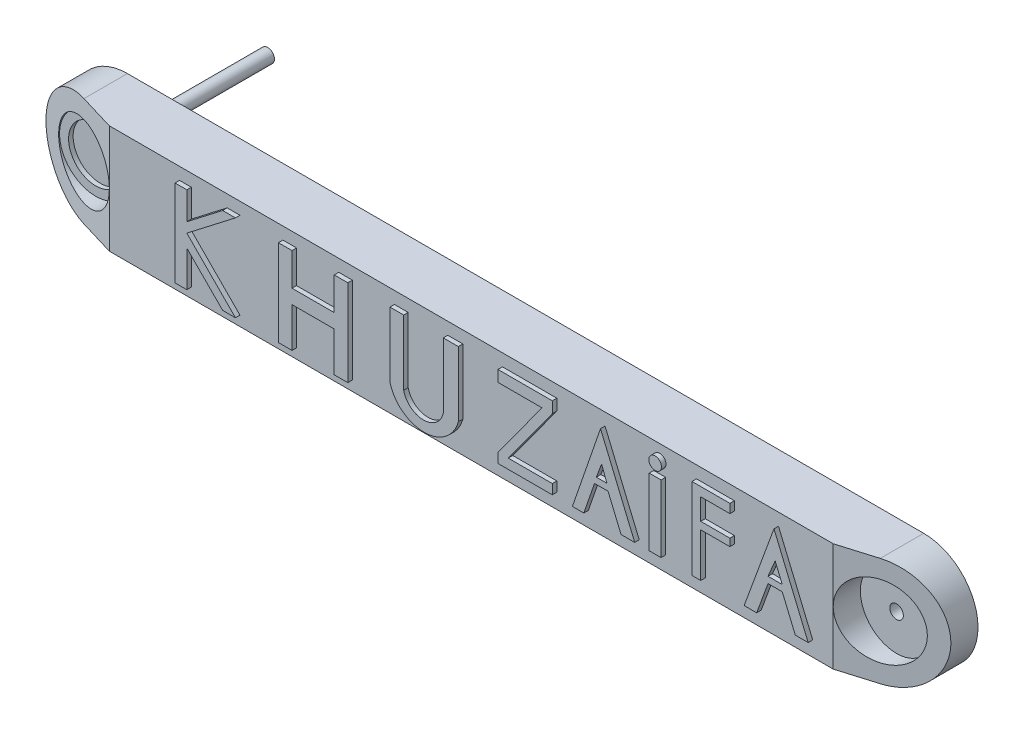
ISO-10303-21;
HEADER;
FILE_DESCRIPTION(('STEP AP214'),'2;1');
FILE_NAME('part.step','',(''),(''),'','','');
FILE_SCHEMA(('AUTOMOTIVE_DESIGN { 1 0 10303 214 1 1 1 1 }'));
ENDSEC;
DATA;
#1=APPLICATION_CONTEXT('core data for automotive mechanical design processes');
#2=APPLICATION_PROTOCOL_DEFINITION('international standard','automotive_design',2000,#1);
#3=PRODUCT_CONTEXT('',#1,'mechanical');
#4=PRODUCT('Part','Part','',(#3));
#5=PRODUCT_RELATED_PRODUCT_CATEGORY('part','',(#4));
#6=PRODUCT_DEFINITION_FORMATION('','',#4);
#7=PRODUCT_DEFINITION_CONTEXT('part definition',#1,'design');
#8=PRODUCT_DEFINITION('design','',#6,#7);
#9=PRODUCT_DEFINITION_SHAPE('','',#8);
#10=(LENGTH_UNIT() NAMED_UNIT(*) SI_UNIT(.MILLI.,.METRE.));
#11=(NAMED_UNIT(*) PLANE_ANGLE_UNIT() SI_UNIT($,.RADIAN.));
#12=(NAMED_UNIT(*) SI_UNIT($,.STERADIAN.) SOLID_ANGLE_UNIT());
#13=UNCERTAINTY_MEASURE_WITH_UNIT(LENGTH_MEASURE(1.E-05),#10,'distance_accuracy_value','');
#14=(GEOMETRIC_REPRESENTATION_CONTEXT(3) GLOBAL_UNCERTAINTY_ASSIGNED_CONTEXT((#13)) GLOBAL_UNIT_ASSIGNED_CONTEXT((#10,
#11,#12)) REPRESENTATION_CONTEXT('',''));
#15=CARTESIAN_POINT('',(0.,0.,0.));
#16=DIRECTION('',(0.,0.,1.));
#17=DIRECTION('',(1.,0.,0.));
#18=AXIS2_PLACEMENT_3D('',#15,#16,#17);
#19=CARTESIAN_POINT('',(0.,0.,60.));
#20=DIRECTION('',(0.,0.,-1.));
#21=DIRECTION('',(-1.,0.,0.));
#22=AXIS2_PLACEMENT_3D('',#19,#20,#21);
#23=PLANE('',#22);
#24=DIRECTION('',(1.,0.,0.));
#25=VECTOR('',#24,1.);
#26=CARTESIAN_POINT('',(0.,93.1309175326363,60.));
#27=LINE('',#26,#25);
#28=CARTESIAN_POINT('',(-644.706181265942,93.1309175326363,60.));
#29=VERTEX_POINT('',#28);
#30=CARTESIAN_POINT('',(-618.685897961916,93.1309175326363,60.));
#31=VERTEX_POINT('',#30);
#32=EDGE_CURVE('E47',#29,#31,#27,.T.);
#33=ORIENTED_EDGE('',*,*,#32,.T.);
#34=DIRECTION('',(0.,-1.,0.));
#35=VECTOR('',#34,1.);
#36=CARTESIAN_POINT('',(-618.685897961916,0.,60.));
#37=LINE('',#36,#35);
#38=CARTESIAN_POINT('',(-618.685897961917,32.039817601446,60.));
#39=VERTEX_POINT('',#38);
#40=EDGE_CURVE('E11',#31,#39,#37,.T.);
#41=ORIENTED_EDGE('',*,*,#40,.T.);
#42=DIRECTION('',(0.791782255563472,0.610803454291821,0.));
#43=VECTOR('',#42,1.);
#44=CARTESIAN_POINT('',(-246.315070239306,319.297313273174,60.));
#45=LINE('',#44,#43);
#46=CARTESIAN_POINT('',(-539.493731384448,93.1309175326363,60.));
#47=VERTEX_POINT('',#46);
#48=EDGE_CURVE('E1229',#39,#47,#45,.T.);
#49=ORIENTED_EDGE('',*,*,#48,.T.);
#50=DIRECTION('',(1.,0.,0.));
#51=VECTOR('',#50,1.);
#52=CARTESIAN_POINT('',(0.,93.1309175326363,60.));
#53=LINE('',#52,#51);
#54=CARTESIAN_POINT('',(-511.210814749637,93.1309175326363,60.));
#55=VERTEX_POINT('',#54);
#56=EDGE_CURVE('E1232',#47,#55,#53,.T.);
#57=ORIENTED_EDGE('',*,*,#56,.T.);
#58=DIRECTION('',(-0.791782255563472,-0.610803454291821,0.));
#59=VECTOR('',#58,1.);
#60=CARTESIAN_POINT('',(-235.763255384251,305.619034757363,60.));
#61=LINE('',#60,#59);
#62=CARTESIAN_POINT('',(-618.685897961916,10.2215676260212,60.));
#63=VERTEX_POINT('',#62);
#64=EDGE_CURVE('E1235',#55,#63,#61,.T.);
#65=ORIENTED_EDGE('',*,*,#64,.T.);
#66=DIRECTION('',(0.704453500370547,-0.709750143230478,0.));
#67=VECTOR('',#66,1.);
#68=CARTESIAN_POINT('',(-306.549451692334,-304.261769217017,60.));
#69=LINE('',#68,#67);
#70=CARTESIAN_POINT('',(-511.210814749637,-98.0615989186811,60.));
#71=VERTEX_POINT('',#70);
#72=EDGE_CURVE('E1238',#63,#71,#69,.T.);
#73=ORIENTED_EDGE('',*,*,#72,.T.);
#74=DIRECTION('',(-1.,0.,0.));
#75=VECTOR('',#74,1.);
#76=CARTESIAN_POINT('',(0.,-98.0615989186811,60.));
#77=LINE('',#76,#75);
#78=CARTESIAN_POINT('',(-539.493731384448,-98.0615989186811,60.));
#79=VERTEX_POINT('',#78);
#80=EDGE_CURVE('E1241',#71,#79,#77,.T.);
#81=ORIENTED_EDGE('',*,*,#80,.T.);
#82=DIRECTION('',(-0.704453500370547,0.709750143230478,0.));
#83=VECTOR('',#82,1.);
#84=CARTESIAN_POINT('',(-320.796837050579,-318.402830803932,60.));
#85=LINE('',#84,#83);
#86=CARTESIAN_POINT('',(-618.685897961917,-18.2740025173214,60.));
#87=VERTEX_POINT('',#86);
#88=EDGE_CURVE('E1244',#79,#87,#85,.T.);
#89=ORIENTED_EDGE('',*,*,#88,.T.);
#90=DIRECTION('',(0.,-1.,0.));
#91=VECTOR('',#90,1.);
#92=CARTESIAN_POINT('',(-618.685897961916,0.,60.));
#93=LINE('',#92,#91);
#94=CARTESIAN_POINT('',(-618.685897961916,-98.0615989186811,60.));
#95=VERTEX_POINT('',#94);
#96=EDGE_CURVE('E1247',#87,#95,#93,.T.);
#97=ORIENTED_EDGE('',*,*,#96,.T.);
#98=DIRECTION('',(1.,0.,0.));
#99=VECTOR('',#98,1.);
#100=CARTESIAN_POINT('',(0.,-98.0615989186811,60.));
#101=LINE('',#100,#99);
#102=CARTESIAN_POINT('',(-644.706181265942,-98.0615989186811,60.));
#103=VERTEX_POINT('',#102);
#104=EDGE_CURVE('E1250',#103,#95,#101,.T.);
#105=ORIENTED_EDGE('',*,*,#104,.F.);
#106=DIRECTION('',(0.,-1.,0.));
#107=VECTOR('',#106,1.);
#108=CARTESIAN_POINT('',(-644.706181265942,0.,60.));
#109=LINE('',#108,#107);
#110=EDGE_CURVE('E1252',#29,#103,#109,.T.);
#111=ORIENTED_EDGE('',*,*,#110,.F.);
#112=EDGE_LOOP('',(#33,#41,#49,#57,#65,#73,#81,#89,#97,#105,#111));
#113=FACE_BOUND('',#112,.T.);
#114=DIRECTION('',(1.,0.,0.));
#115=VECTOR('',#114,1.);
#116=CARTESIAN_POINT('',(0.,93.1309175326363,60.));
#117=LINE('',#116,#115);
#118=CARTESIAN_POINT('',(-292.866698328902,93.1309175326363,60.));
#119=VERTEX_POINT('',#118);
#120=CARTESIAN_POINT('',(-262.866698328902,93.1309175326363,60.));
#121=VERTEX_POINT('',#120);
#122=EDGE_CURVE('E62',#119,#121,#117,.T.);
#123=ORIENTED_EDGE('',*,*,#122,.T.);
#124=DIRECTION('',(0.,-1.,0.));
#125=VECTOR('',#124,1.);
#126=CARTESIAN_POINT('',(-262.866698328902,0.,60.));
#127=LINE('',#126,#125);
#128=CARTESIAN_POINT('',(-262.866698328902,-98.0615989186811,60.));
#129=VERTEX_POINT('',#128);
#130=EDGE_CURVE('E1227',#121,#129,#127,.T.);
#131=ORIENTED_EDGE('',*,*,#130,.T.);
#132=DIRECTION('',(1.,0.,0.));
#133=VECTOR('',#132,1.);
#134=CARTESIAN_POINT('',(0.,-98.0615989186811,60.));
#135=LINE('',#134,#133);
#136=CARTESIAN_POINT('',(-292.866698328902,-98.0615989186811,60.));
#137=VERTEX_POINT('',#136);
#138=EDGE_CURVE('E1200',#137,#129,#135,.T.);
#139=ORIENTED_EDGE('',*,*,#138,.F.);
#140=DIRECTION('',(0.,-1.,0.));
#141=VECTOR('',#140,1.);
#142=CARTESIAN_POINT('',(-292.866698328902,0.,60.));
#143=LINE('',#142,#141);
#144=CARTESIAN_POINT('',(-292.866698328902,-10.3352352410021,60.));
#145=VERTEX_POINT('',#144);
#146=EDGE_CURVE('E1203',#145,#137,#143,.T.);
#147=ORIENTED_EDGE('',*,*,#146,.F.);
#148=DIRECTION('',(1.,0.,0.));
#149=VECTOR('',#148,1.);
#150=CARTESIAN_POINT('',(0.,-10.3352352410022,60.));
#151=LINE('',#150,#149);
#152=CARTESIAN_POINT('',(-386.180214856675,-10.335235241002,60.));
#153=VERTEX_POINT('',#152);
#154=EDGE_CURVE('E1206',#153,#145,#151,.T.);
#155=ORIENTED_EDGE('',*,*,#154,.F.);
#156=DIRECTION('',(0.,-1.,0.));
#157=VECTOR('',#156,1.);
#158=CARTESIAN_POINT('',(-386.180214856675,-2.24248403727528E-13,60.));
#159=LINE('',#158,#157);
#160=CARTESIAN_POINT('',(-386.180214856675,-98.0615989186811,60.));
#161=VERTEX_POINT('',#160);
#162=EDGE_CURVE('E1209',#153,#161,#159,.T.);
#163=ORIENTED_EDGE('',*,*,#162,.T.);
#164=DIRECTION('',(1.,0.,0.));
#165=VECTOR('',#164,1.);
#166=CARTESIAN_POINT('',(0.,-98.0615989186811,60.));
#167=LINE('',#166,#165);
#168=CARTESIAN_POINT('',(-416.180214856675,-98.0615989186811,60.));
#169=VERTEX_POINT('',#168);
#170=EDGE_CURVE('E1211',#169,#161,#167,.T.);
#171=ORIENTED_EDGE('',*,*,#170,.F.);
#172=DIRECTION('',(0.,-1.,0.));
#173=VECTOR('',#172,1.);
#174=CARTESIAN_POINT('',(-416.180214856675,-1.20834451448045E-13,60.));
#175=LINE('',#174,#173);
#176=CARTESIAN_POINT('',(-416.180214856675,93.1309175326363,60.));
#177=VERTEX_POINT('',#176);
#178=EDGE_CURVE('E1214',#177,#169,#175,.T.);
#179=ORIENTED_EDGE('',*,*,#178,.F.);
#180=DIRECTION('',(1.,0.,0.));
#181=VECTOR('',#180,1.);
#182=CARTESIAN_POINT('',(0.,93.1309175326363,60.));
#183=LINE('',#182,#181);
#184=CARTESIAN_POINT('',(-386.180214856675,93.1309175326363,60.));
#185=VERTEX_POINT('',#184);
#186=EDGE_CURVE('E1217',#177,#185,#183,.T.);
#187=ORIENTED_EDGE('',*,*,#186,.T.);
#188=DIRECTION('',(0.,-1.,0.));
#189=VECTOR('',#188,1.);
#190=CARTESIAN_POINT('',(-386.180214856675,-2.24248403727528E-13,60.));
#191=LINE('',#190,#189);
#192=CARTESIAN_POINT('',(-386.180214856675,21.0000405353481,60.));
#193=VERTEX_POINT('',#192);
#194=EDGE_CURVE('E1219',#185,#193,#191,.T.);
#195=ORIENTED_EDGE('',*,*,#194,.T.);
#196=DIRECTION('',(1.,0.,0.));
#197=VECTOR('',#196,1.);
#198=CARTESIAN_POINT('',(0.,21.000040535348,60.));
#199=LINE('',#198,#197);
#200=CARTESIAN_POINT('',(-292.866698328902,21.0000405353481,60.));
#201=VERTEX_POINT('',#200);
#202=EDGE_CURVE('E1221',#193,#201,#199,.T.);
#203=ORIENTED_EDGE('',*,*,#202,.T.);
#204=DIRECTION('',(0.,-1.,0.));
#205=VECTOR('',#204,1.);
#206=CARTESIAN_POINT('',(-292.866698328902,0.,60.));
#207=LINE('',#206,#205);
#208=EDGE_CURVE('E1223',#119,#201,#207,.T.);
#209=ORIENTED_EDGE('',*,*,#208,.F.);
#210=EDGE_LOOP('',(#123,#131,#139,#147,#155,#163,#171,#179,#187,#195,#203,#209));
#211=FACE_BOUND('',#210,.T.);
#212=DIRECTION('',(-1.,0.,0.));
#213=VECTOR('',#212,1.);
#214=CARTESIAN_POINT('',(-1000.,120.,60.));
#215=LINE('',#214,#213);
#216=CARTESIAN_POINT('',(800.,120.,60.));
#217=VERTEX_POINT('',#216);
#218=CARTESIAN_POINT('',(-800.,120.,60.));
#219=VERTEX_POINT('',#218);
#220=EDGE_CURVE('E1029',#217,#219,#215,.T.);
#221=ORIENTED_EDGE('',*,*,#220,.T.);
#222=DIRECTION('',(0.,1.,0.));
#223=VECTOR('',#222,1.);
#224=CARTESIAN_POINT('',(-800.,-321.,60.));
#225=LINE('',#224,#223);
#226=CARTESIAN_POINT('',(-800.,0.,60.));
#227=VERTEX_POINT('',#226);
#228=EDGE_CURVE('E982',#227,#219,#225,.T.);
#229=ORIENTED_EDGE('',*,*,#228,.F.);
#230=CARTESIAN_POINT('',(-800.,-120.,60.));
#231=VERTEX_POINT('',#230);
#232=EDGE_CURVE('E984',#231,#227,#225,.T.);
#233=ORIENTED_EDGE('',*,*,#232,.F.);
#234=DIRECTION('',(1.,0.,0.));
#235=VECTOR('',#234,1.);
#236=CARTESIAN_POINT('',(-1000.,-120.,60.));
#237=LINE('',#236,#235);
#238=CARTESIAN_POINT('',(800.,-120.,60.));
#239=VERTEX_POINT('',#238);
#240=EDGE_CURVE('E1026',#231,#239,#237,.T.);
#241=ORIENTED_EDGE('',*,*,#240,.T.);
#242=DIRECTION('',(0.,1.,0.));
#243=VECTOR('',#242,1.);
#244=CARTESIAN_POINT('',(800.,-321.,60.));
#245=LINE('',#244,#243);
#246=CARTESIAN_POINT('',(800.,0.,60.));
#247=VERTEX_POINT('',#246);
#248=EDGE_CURVE('E985',#239,#247,#245,.T.);
#249=ORIENTED_EDGE('',*,*,#248,.T.);
#250=EDGE_CURVE('E981',#247,#217,#245,.T.);
#251=ORIENTED_EDGE('',*,*,#250,.T.);
#252=EDGE_LOOP('',(#221,#229,#233,#241,#249,#251));
#253=FACE_BOUND('',#252,.T.);
#254=DIRECTION('',(-0.344044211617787,-0.938953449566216,0.));
#255=VECTOR('',#254,1.);
#256=CARTESIAN_POINT('',(592.982828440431,-217.276276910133,60.));
#257=LINE('',#256,#255);
#258=CARTESIAN_POINT('',(665.899734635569,-18.2740025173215,60.));
#259=VERTEX_POINT('',#258);
#260=CARTESIAN_POINT('',(640.788844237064,-86.8057678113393,60.));
#261=VERTEX_POINT('',#260);
#262=EDGE_CURVE('E1068',#259,#261,#257,.T.);
#263=ORIENTED_EDGE('',*,*,#262,.T.);
#264=DIRECTION('',(-1.,0.,0.));
#265=VECTOR('',#264,1.);
#266=CARTESIAN_POINT('',(0.,-86.8057678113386,60.));
#267=LINE('',#266,#265);
#268=CARTESIAN_POINT('',(613.107018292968,-86.8057678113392,60.));
#269=VERTEX_POINT('',#268);
#270=EDGE_CURVE('E1071',#261,#269,#267,.T.);
#271=ORIENTED_EDGE('',*,*,#270,.T.);
#272=DIRECTION('',(0.344044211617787,0.938953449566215,0.));
#273=VECTOR('',#272,1.);
#274=CARTESIAN_POINT('',(568.57760111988,-208.33389835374,60.));
#275=LINE('',#274,#273);
#276=CARTESIAN_POINT('',(679.038055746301,93.1309175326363,60.));
#277=VERTEX_POINT('',#276);
#278=EDGE_CURVE('E1049',#269,#277,#275,.T.);
#279=ORIENTED_EDGE('',*,*,#278,.T.);
#280=DIRECTION('',(0.387656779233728,-0.921803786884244,0.));
#281=VECTOR('',#280,1.);
#282=CARTESIAN_POINT('',(610.273452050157,256.645334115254,60.));
#283=LINE('',#282,#281);
#284=CARTESIAN_POINT('',(754.708905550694,-86.8057678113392,60.));
#285=VERTEX_POINT('',#284);
#286=EDGE_CURVE('E1056',#277,#285,#283,.T.);
#287=ORIENTED_EDGE('',*,*,#286,.T.);
#288=DIRECTION('',(-1.,0.,0.));
#289=VECTOR('',#288,1.);
#290=CARTESIAN_POINT('',(0.,-86.8057678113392,60.));
#291=LINE('',#290,#289);
#292=CARTESIAN_POINT('',(726.238684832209,-86.8057678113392,60.));
#293=VERTEX_POINT('',#292);
#294=EDGE_CURVE('E1059',#285,#293,#291,.T.);
#295=ORIENTED_EDGE('',*,*,#294,.T.);
#296=DIRECTION('',(-0.387656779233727,0.921803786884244,0.));
#297=VECTOR('',#296,1.);
#298=CARTESIAN_POINT('',(586.081672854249,246.471686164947,60.));
#299=LINE('',#298,#297);
#300=CARTESIAN_POINT('',(697.41823107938,-18.2740025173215,60.));
#301=VERTEX_POINT('',#300);
#302=EDGE_CURVE('E1062',#293,#301,#299,.T.);
#303=ORIENTED_EDGE('',*,*,#302,.T.);
#304=DIRECTION('',(-1.,0.,0.));
#305=VECTOR('',#304,1.);
#306=CARTESIAN_POINT('',(0.,-18.2740025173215,60.));
#307=LINE('',#306,#305);
#308=EDGE_CURVE('E1065',#301,#259,#307,.T.);
#309=ORIENTED_EDGE('',*,*,#308,.T.);
#310=EDGE_LOOP('',(#263,#271,#279,#287,#295,#303,#309));
#311=FACE_BOUND('',#310,.T.);
#312=DIRECTION('',(1.,0.,0.));
#313=VECTOR('',#312,1.);
#314=CARTESIAN_POINT('',(0.,73.4601288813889,60.));
#315=LINE('',#314,#313);
#316=CARTESIAN_POINT('',(517.207327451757,73.4601288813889,60.));
#317=VERTEX_POINT('',#316);
#318=CARTESIAN_POINT('',(581.639932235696,73.4601288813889,60.));
#319=VERTEX_POINT('',#318);
#320=EDGE_CURVE('E1104',#317,#319,#315,.T.);
#321=ORIENTED_EDGE('',*,*,#320,.F.);
#322=DIRECTION('',(0.,-1.,0.));
#323=VECTOR('',#322,1.);
#324=CARTESIAN_POINT('',(517.207327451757,0.,60.));
#325=LINE('',#324,#323);
#326=CARTESIAN_POINT('',(517.207327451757,26.5146663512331,60.));
#327=VERTEX_POINT('',#326);
#328=EDGE_CURVE('E1106',#317,#327,#325,.T.);
#329=ORIENTED_EDGE('',*,*,#328,.T.);
#330=DIRECTION('',(1.,0.,0.));
#331=VECTOR('',#330,1.);
#332=CARTESIAN_POINT('',(0.,26.5146663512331,60.));
#333=LINE('',#332,#331);
#334=CARTESIAN_POINT('',(581.639932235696,26.5146663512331,60.));
#335=VERTEX_POINT('',#334);
#336=EDGE_CURVE('E1083',#327,#335,#333,.T.);
#337=ORIENTED_EDGE('',*,*,#336,.T.);
#338=DIRECTION('',(0.,1.,0.));
#339=VECTOR('',#338,1.);
#340=CARTESIAN_POINT('',(581.639932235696,0.,60.));
#341=LINE('',#340,#339);
#342=CARTESIAN_POINT('',(581.639932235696,10.2215676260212,60.));
#343=VERTEX_POINT('',#342);
#344=EDGE_CURVE('E1086',#343,#335,#341,.T.);
#345=ORIENTED_EDGE('',*,*,#344,.F.);
#346=DIRECTION('',(1.,0.,0.));
#347=VECTOR('',#346,1.);
#348=CARTESIAN_POINT('',(0.,10.2215676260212,60.));
#349=LINE('',#348,#347);
#350=CARTESIAN_POINT('',(517.207327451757,10.2215676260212,60.));
#351=VERTEX_POINT('',#350);
#352=EDGE_CURVE('E1089',#351,#343,#349,.T.);
#353=ORIENTED_EDGE('',*,*,#352,.F.);
#354=DIRECTION('',(0.,-1.,0.));
#355=VECTOR('',#354,1.);
#356=CARTESIAN_POINT('',(517.207327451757,0.,60.));
#357=LINE('',#356,#355);
#358=CARTESIAN_POINT('',(517.207327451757,-86.8057678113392,60.));
#359=VERTEX_POINT('',#358);
#360=EDGE_CURVE('E1091',#351,#359,#357,.T.);
#361=ORIENTED_EDGE('',*,*,#360,.T.);
#362=DIRECTION('',(1.,0.,0.));
#363=VECTOR('',#362,1.);
#364=CARTESIAN_POINT('',(0.,-86.8057678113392,60.));
#365=LINE('',#364,#363);
#366=CARTESIAN_POINT('',(497.727702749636,-86.8057678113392,60.));
#367=VERTEX_POINT('',#366);
#368=EDGE_CURVE('E1094',#367,#359,#365,.T.);
#369=ORIENTED_EDGE('',*,*,#368,.F.);
#370=DIRECTION('',(0.,-1.,0.));
#371=VECTOR('',#370,1.);
#372=CARTESIAN_POINT('',(497.727702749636,0.,60.));
#373=LINE('',#372,#371);
#374=CARTESIAN_POINT('',(497.727702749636,93.1309175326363,60.));
#375=VERTEX_POINT('',#374);
#376=EDGE_CURVE('E1096',#375,#367,#373,.T.);
#377=ORIENTED_EDGE('',*,*,#376,.F.);
#378=DIRECTION('',(1.,0.,0.));
#379=VECTOR('',#378,1.);
#380=CARTESIAN_POINT('',(0.,93.1309175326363,60.));
#381=LINE('',#380,#379);
#382=CARTESIAN_POINT('',(581.639932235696,93.1309175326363,60.));
#383=VERTEX_POINT('',#382);
#384=EDGE_CURVE('E1098',#375,#383,#381,.T.);
#385=ORIENTED_EDGE('',*,*,#384,.T.);
#386=DIRECTION('',(0.,-1.,0.));
#387=VECTOR('',#386,1.);
#388=CARTESIAN_POINT('',(581.639932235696,0.,60.));
#389=LINE('',#388,#387);
#390=EDGE_CURVE('E1101',#383,#319,#389,.T.);
#391=ORIENTED_EDGE('',*,*,#390,.T.);
#392=EDGE_LOOP('',(#321,#329,#337,#345,#353,#361,#369,#377,#385,#391));
#393=FACE_BOUND('',#392,.T.);
#394=DIRECTION('',(1.,0.,0.));
#395=VECTOR('',#394,1.);
#396=CARTESIAN_POINT('',(0.,61.9280367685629,60.));
#397=LINE('',#396,#395);
#398=CARTESIAN_POINT('',(403.326444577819,61.9280367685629,60.));
#399=VERTEX_POINT('',#398);
#400=CARTESIAN_POINT('',(429.549016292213,61.9280367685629,60.));
#401=VERTEX_POINT('',#400);
#402=EDGE_CURVE('E1115',#399,#401,#397,.T.);
#403=ORIENTED_EDGE('',*,*,#402,.T.);
#404=DIRECTION('',(0.,-1.,0.));
#405=VECTOR('',#404,1.);
#406=CARTESIAN_POINT('',(429.549016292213,0.,60.));
#407=LINE('',#406,#405);
#408=CARTESIAN_POINT('',(429.549016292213,-86.8057678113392,60.));
#409=VERTEX_POINT('',#408);
#410=EDGE_CURVE('E1117',#401,#409,#407,.T.);
#411=ORIENTED_EDGE('',*,*,#410,.T.);
#412=DIRECTION('',(1.,0.,0.));
#413=VECTOR('',#412,1.);
#414=CARTESIAN_POINT('',(0.,-86.8057678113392,60.));
#415=LINE('',#414,#413);
#416=CARTESIAN_POINT('',(403.326444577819,-86.8057678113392,60.));
#417=VERTEX_POINT('',#416);
#418=EDGE_CURVE('E1109',#417,#409,#415,.T.);
#419=ORIENTED_EDGE('',*,*,#418,.F.);
#420=DIRECTION('',(0.,-1.,0.));
#421=VECTOR('',#420,1.);
#422=CARTESIAN_POINT('',(403.326444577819,0.,60.));
#423=LINE('',#422,#421);
#424=EDGE_CURVE('E1112',#399,#417,#423,.T.);
#425=ORIENTED_EDGE('',*,*,#424,.F.);
#426=EDGE_LOOP('',(#403,#411,#419,#425));
#427=FACE_BOUND('',#426,.T.);
#428=CARTESIAN_POINT('',(416.437730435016,87.4013921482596,60.));
#429=DIRECTION('',(0.,0.,-1.));
#430=DIRECTION('',(-1.,0.,0.));
#431=AXIS2_PLACEMENT_3D('',#428,#429,#430);
#432=CIRCLE('',#431,13.9412632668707);
#433=CARTESIAN_POINT('',(402.496467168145,87.4013921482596,60.));
#434=VERTEX_POINT('',#433);
#435=EDGE_CURVE('E1119',#434,#434,#432,.F.);
#436=ORIENTED_EDGE('',*,*,#435,.F.);
#437=EDGE_LOOP('',(#436));
#438=FACE_BOUND('',#437,.T.);
#439=DIRECTION('',(-0.326150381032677,-0.945317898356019,0.));
#440=VECTOR('',#439,1.);
#441=CARTESIAN_POINT('',(258.006770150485,-89.0166223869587,60.));
#442=LINE('',#441,#440);
#443=CARTESIAN_POINT('',(282.414149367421,-18.2740025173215,60.));
#444=VERTEX_POINT('',#443);
#445=CARTESIAN_POINT('',(258.769551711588,-86.8057678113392,60.));
#446=VERTEX_POINT('',#445);
#447=EDGE_CURVE('E1137',#444,#446,#442,.T.);
#448=ORIENTED_EDGE('',*,*,#447,.T.);
#449=DIRECTION('',(-1.,0.,0.));
#450=VECTOR('',#449,1.);
#451=CARTESIAN_POINT('',(0.,-86.8057678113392,60.));
#452=LINE('',#451,#450);
#453=CARTESIAN_POINT('',(233.581491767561,-86.8057678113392,60.));
#454=VERTEX_POINT('',#453);
#455=EDGE_CURVE('E1140',#446,#454,#452,.T.);
#456=ORIENTED_EDGE('',*,*,#455,.T.);
#457=DIRECTION('',(0.326150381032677,0.945317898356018,0.));
#458=VECTOR('',#457,1.);
#459=CARTESIAN_POINT('',(235.4980666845,-81.2507457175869,60.));
#460=LINE('',#459,#458);
#461=CARTESIAN_POINT('',(295.662637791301,93.1309175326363,60.));
#462=VERTEX_POINT('',#461);
#463=EDGE_CURVE('E1122',#454,#462,#460,.T.);
#464=ORIENTED_EDGE('',*,*,#463,.T.);
#465=DIRECTION('',(0.387248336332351,-0.921975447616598,0.));
#466=VECTOR('',#465,1.);
#467=CARTESIAN_POINT('',(284.575545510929,119.527485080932,60.));
#468=LINE('',#467,#466);
#469=CARTESIAN_POINT('',(371.239685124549,-86.8057678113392,60.));
#470=VERTEX_POINT('',#469);
#471=EDGE_CURVE('E1125',#462,#470,#468,.T.);
#472=ORIENTED_EDGE('',*,*,#471,.T.);
#473=DIRECTION('',(-1.,0.,0.));
#474=VECTOR('',#473,1.);
#475=CARTESIAN_POINT('',(0.,-86.8057678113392,60.));
#476=LINE('',#475,#474);
#477=CARTESIAN_POINT('',(341.090764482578,-86.8057678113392,60.));
#478=VERTEX_POINT('',#477);
#479=EDGE_CURVE('E1128',#470,#478,#476,.T.);
#480=ORIENTED_EDGE('',*,*,#479,.T.);
#481=DIRECTION('',(-0.387248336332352,0.921975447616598,0.));
#482=VECTOR('',#481,1.);
#483=CARTESIAN_POINT('',(258.947795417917,108.763311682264,60.));
#484=LINE('',#483,#482);
#485=CARTESIAN_POINT('',(312.306036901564,-18.2740025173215,60.));
#486=VERTEX_POINT('',#485);
#487=EDGE_CURVE('E1131',#478,#486,#484,.T.);
#488=ORIENTED_EDGE('',*,*,#487,.T.);
#489=DIRECTION('',(-1.,0.,0.));
#490=VECTOR('',#489,1.);
#491=CARTESIAN_POINT('',(0.,-18.2740025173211,60.));
#492=LINE('',#491,#490);
#493=EDGE_CURVE('E1134',#486,#444,#492,.T.);
#494=ORIENTED_EDGE('',*,*,#493,.T.);
#495=EDGE_LOOP('',(#448,#456,#464,#472,#480,#488,#494));
#496=FACE_BOUND('',#495,.T.);
#497=DIRECTION('',(1.,0.,0.));
#498=VECTOR('',#497,1.);
#499=CARTESIAN_POINT('',(0.,-86.8057678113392,60.));
#500=LINE('',#499,#498);
#501=CARTESIAN_POINT('',(68.9314957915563,-86.8057678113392,60.));
#502=VERTEX_POINT('',#501);
#503=CARTESIAN_POINT('',(189.045017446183,-86.8057678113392,60.));
#504=VERTEX_POINT('',#503);
#505=EDGE_CURVE('E1176',#502,#504,#500,.T.);
#506=ORIENTED_EDGE('',*,*,#505,.F.);
#507=DIRECTION('',(0.,1.,0.));
#508=VECTOR('',#507,1.);
#509=CARTESIAN_POINT('',(68.9314957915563,0.,60.));
#510=LINE('',#509,#508);
#511=CARTESIAN_POINT('',(68.9314957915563,-65.2123257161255,60.));
#512=VERTEX_POINT('',#511);
#513=EDGE_CURVE('E1152',#502,#512,#510,.T.);
#514=ORIENTED_EDGE('',*,*,#513,.T.);
#515=DIRECTION('',(0.590031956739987,0.807379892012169,0.));
#516=VECTOR('',#515,1.);
#517=CARTESIAN_POINT('',(75.9996863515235,-55.5404513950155,60.));
#518=LINE('',#517,#516);
#519=CARTESIAN_POINT('',(166.573052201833,68.3970972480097,60.));
#520=VERTEX_POINT('',#519);
#521=EDGE_CURVE('E1155',#512,#520,#518,.T.);
#522=ORIENTED_EDGE('',*,*,#521,.T.);
#523=DIRECTION('',(1.,0.,0.));
#524=VECTOR('',#523,1.);
#525=CARTESIAN_POINT('',(0.,68.3970972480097,60.));
#526=LINE('',#525,#524);
#527=CARTESIAN_POINT('',(68.9314957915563,68.3970972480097,60.));
#528=VERTEX_POINT('',#527);
#529=EDGE_CURVE('E1158',#528,#520,#526,.T.);
#530=ORIENTED_EDGE('',*,*,#529,.F.);
#531=DIRECTION('',(0.,-1.,0.));
#532=VECTOR('',#531,1.);
#533=CARTESIAN_POINT('',(68.9314957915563,0.,60.));
#534=LINE('',#533,#532);
#535=CARTESIAN_POINT('',(68.9314957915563,93.1309175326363,60.));
#536=VERTEX_POINT('',#535);
#537=EDGE_CURVE('E1160',#536,#528,#534,.T.);
#538=ORIENTED_EDGE('',*,*,#537,.F.);
#539=DIRECTION('',(1.,0.,0.));
#540=VECTOR('',#539,1.);
#541=CARTESIAN_POINT('',(0.,93.1309175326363,60.));
#542=LINE('',#541,#540);
#543=CARTESIAN_POINT('',(189.045017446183,93.1309175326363,60.));
#544=VERTEX_POINT('',#543);
#545=EDGE_CURVE('E1162',#536,#544,#542,.T.);
#546=ORIENTED_EDGE('',*,*,#545,.T.);
#547=DIRECTION('',(0.,-1.,0.));
#548=VECTOR('',#547,1.);
#549=CARTESIAN_POINT('',(189.045017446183,0.,60.));
#550=LINE('',#549,#548);
#551=CARTESIAN_POINT('',(189.045017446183,68.3970972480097,60.));
#552=VERTEX_POINT('',#551);
#553=EDGE_CURVE('E1165',#544,#552,#550,.T.);
#554=ORIENTED_EDGE('',*,*,#553,.T.);
#555=DIRECTION('',(-0.588880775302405,-0.808219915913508,0.));
#556=VECTOR('',#555,1.);
#557=CARTESIAN_POINT('',(90.9346108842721,-66.2562788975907,60.));
#558=LINE('',#557,#556);
#559=CARTESIAN_POINT('',(91.6952503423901,-65.2123257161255,60.));
#560=VERTEX_POINT('',#559);
#561=EDGE_CURVE('E1168',#552,#560,#558,.T.);
#562=ORIENTED_EDGE('',*,*,#561,.T.);
#563=DIRECTION('',(1.,0.,0.));
#564=VECTOR('',#563,1.);
#565=CARTESIAN_POINT('',(0.,-65.2123257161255,60.));
#566=LINE('',#565,#564);
#567=CARTESIAN_POINT('',(189.045017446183,-65.2123257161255,60.));
#568=VERTEX_POINT('',#567);
#569=EDGE_CURVE('E1171',#560,#568,#566,.T.);
#570=ORIENTED_EDGE('',*,*,#569,.T.);
#571=DIRECTION('',(0.,1.,0.));
#572=VECTOR('',#571,1.);
#573=CARTESIAN_POINT('',(189.045017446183,0.,60.));
#574=LINE('',#573,#572);
#575=EDGE_CURVE('E1174',#504,#568,#574,.T.);
#576=ORIENTED_EDGE('',*,*,#575,.F.);
#577=EDGE_LOOP('',(#506,#514,#522,#530,#538,#546,#554,#562,#570,#576));
#578=FACE_BOUND('',#577,.T.);
#579=DIRECTION('',(1.,0.,0.));
#580=VECTOR('',#579,1.);
#581=CARTESIAN_POINT('',(0.,93.1309175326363,60.));
#582=LINE('',#581,#580);
#583=CARTESIAN_POINT('',(-169.811723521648,93.1309175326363,60.));
#584=VERTEX_POINT('',#583);
#585=CARTESIAN_POINT('',(-139.398073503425,93.1309175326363,60.));
#586=VERTEX_POINT('',#585);
#587=EDGE_CURVE('E1194',#584,#586,#582,.T.);
#588=ORIENTED_EDGE('',*,*,#587,.T.);
#589=DIRECTION('',(0.,-1.,0.));
#590=VECTOR('',#589,1.);
#591=CARTESIAN_POINT('',(-139.398073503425,0.,60.));
#592=LINE('',#591,#590);
#593=CARTESIAN_POINT('',(-139.398073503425,-50.8867685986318,60.));
#594=VERTEX_POINT('',#593);
#595=EDGE_CURVE('E1197',#586,#594,#592,.T.);
#596=ORIENTED_EDGE('',*,*,#595,.T.);
#597=CARTESIAN_POINT('',(-95.620849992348,-41.0421298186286,60.));
#598=DIRECTION('',(0.,0.,-1.));
#599=DIRECTION('',(-1.,0.,0.));
#600=AXIS2_PLACEMENT_3D('',#597,#598,#599);
#601=CIRCLE('',#600,44.8705049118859);
#602=CARTESIAN_POINT('',(-51.8436264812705,-50.8867685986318,60.));
#603=VERTEX_POINT('',#602);
#604=EDGE_CURVE('E1178',#594,#603,#601,.F.);
#605=ORIENTED_EDGE('',*,*,#604,.T.);
#606=DIRECTION('',(0.,-1.,0.));
#607=VECTOR('',#606,1.);
#608=CARTESIAN_POINT('',(-51.8436264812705,0.,60.));
#609=LINE('',#608,#607);
#610=CARTESIAN_POINT('',(-51.8436264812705,93.1309175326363,60.));
#611=VERTEX_POINT('',#610);
#612=EDGE_CURVE('E1181',#611,#603,#609,.T.);
#613=ORIENTED_EDGE('',*,*,#612,.F.);
#614=DIRECTION('',(1.,0.,0.));
#615=VECTOR('',#614,1.);
#616=CARTESIAN_POINT('',(0.,93.1309175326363,60.));
#617=LINE('',#616,#615);
#618=CARTESIAN_POINT('',(-18.6650991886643,93.1309175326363,60.));
#619=VERTEX_POINT('',#618);
#620=EDGE_CURVE('E1184',#611,#619,#617,.T.);
#621=ORIENTED_EDGE('',*,*,#620,.T.);
#622=DIRECTION('',(0.,-1.,0.));
#623=VECTOR('',#622,1.);
#624=CARTESIAN_POINT('',(-18.6650991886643,0.,60.));
#625=LINE('',#624,#623);
#626=CARTESIAN_POINT('',(-18.6650991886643,-50.8867685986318,60.));
#627=VERTEX_POINT('',#626);
#628=EDGE_CURVE('E1187',#619,#627,#625,.T.);
#629=ORIENTED_EDGE('',*,*,#628,.T.);
#630=CARTESIAN_POINT('',(-94.238411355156,-30.5362755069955,60.));
#631=DIRECTION('',(0.,0.,-1.));
#632=DIRECTION('',(-1.,0.,0.));
#633=AXIS2_PLACEMENT_3D('',#630,#631,#632);
#634=CIRCLE('',#633,78.2653696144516);
#635=CARTESIAN_POINT('',(-169.811723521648,-50.8867685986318,60.));
#636=VERTEX_POINT('',#635);
#637=EDGE_CURVE('E1190',#636,#627,#634,.F.);
#638=ORIENTED_EDGE('',*,*,#637,.F.);
#639=DIRECTION('',(0.,-1.,0.));
#640=VECTOR('',#639,1.);
#641=CARTESIAN_POINT('',(-169.811723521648,0.,60.));
#642=LINE('',#641,#640);
#643=EDGE_CURVE('E1192',#584,#636,#642,.T.);
#644=ORIENTED_EDGE('',*,*,#643,.F.);
#645=EDGE_LOOP('',(#588,#596,#605,#613,#621,#629,#638,#644));
#646=FACE_BOUND('',#645,.T.);
#647=ADVANCED_FACE('F39',(#113,#211,#253,#311,#393,#427,#438,#496,#578,#646),#23,.F.);
#648=CARTESIAN_POINT('',(0.,0.,-60.));
#649=DIRECTION('',(0.,0.,-1.));
#650=DIRECTION('',(-1.,0.,0.));
#651=AXIS2_PLACEMENT_3D('',#648,#649,#650);
#652=PLANE('',#651);
#653=CARTESIAN_POINT('',(880.,0.,-60.));
#654=DIRECTION('',(0.,0.,-1.));
#655=DIRECTION('',(-1.,0.,0.));
#656=AXIS2_PLACEMENT_3D('',#653,#654,#655);
#657=CIRCLE('',#656,15.);
#658=CARTESIAN_POINT('',(865.,0.,-60.));
#659=VERTEX_POINT('',#658);
#660=EDGE_CURVE('E977',#659,#659,#657,.T.);
#661=ORIENTED_EDGE('',*,*,#660,.F.);
#662=EDGE_LOOP('',(#661));
#663=FACE_BOUND('',#662,.T.);
#664=CARTESIAN_POINT('',(-880.,0.,-60.));
#665=DIRECTION('',(0.,0.,-1.));
#666=DIRECTION('',(-1.,0.,0.));
#667=AXIS2_PLACEMENT_3D('',#664,#665,#666);
#668=CIRCLE('',#667,15.);
#669=CARTESIAN_POINT('',(-895.,0.,-60.));
#670=VERTEX_POINT('',#669);
#671=EDGE_CURVE('E1046',#670,#670,#668,.T.);
#672=ORIENTED_EDGE('',*,*,#671,.F.);
#673=EDGE_LOOP('',(#672));
#674=FACE_BOUND('',#673,.T.);
#675=CARTESIAN_POINT('',(880.,0.,-60.));
#676=DIRECTION('',(0.,0.,-1.));
#677=DIRECTION('',(-1.,0.,0.));
#678=AXIS2_PLACEMENT_3D('',#675,#676,#677);
#679=CIRCLE('',#678,120.);
#680=CARTESIAN_POINT('',(880.,-120.,-60.0000000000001));
#681=VERTEX_POINT('',#680);
#682=CARTESIAN_POINT('',(880.,120.,-60.0000000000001));
#683=VERTEX_POINT('',#682);
#684=EDGE_CURVE('E1034',#681,#683,#679,.F.);
#685=ORIENTED_EDGE('',*,*,#684,.F.);
#686=DIRECTION('',(1.,0.,0.));
#687=VECTOR('',#686,1.);
#688=CARTESIAN_POINT('',(-1000.,-120.,-60.));
#689=LINE('',#688,#687);
#690=CARTESIAN_POINT('',(-880.,-120.,-60.0000000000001));
#691=VERTEX_POINT('',#690);
#692=EDGE_CURVE('E1012',#691,#681,#689,.T.);
#693=ORIENTED_EDGE('',*,*,#692,.F.);
#694=CARTESIAN_POINT('',(-880.,0.,-60.));
#695=DIRECTION('',(0.,0.,-1.));
#696=DIRECTION('',(-1.,0.,0.));
#697=AXIS2_PLACEMENT_3D('',#694,#695,#696);
#698=CIRCLE('',#697,120.);
#699=CARTESIAN_POINT('',(-880.,120.,-60.));
#700=VERTEX_POINT('',#699);
#701=EDGE_CURVE('E1032',#700,#691,#698,.F.);
#702=ORIENTED_EDGE('',*,*,#701,.F.);
#703=DIRECTION('',(-1.,0.,0.));
#704=VECTOR('',#703,1.);
#705=CARTESIAN_POINT('',(-1000.,120.,-60.));
#706=LINE('',#705,#704);
#707=EDGE_CURVE('E1023',#683,#700,#706,.T.);
#708=ORIENTED_EDGE('',*,*,#707,.F.);
#709=EDGE_LOOP('',(#685,#693,#702,#708));
#710=FACE_BOUND('',#709,.T.);
#711=ADVANCED_FACE('F1291',(#663,#674,#710),#652,.T.);
#712=CARTESIAN_POINT('',(-1000.,-120.,60.));
#713=DIRECTION('',(0.,1.,0.));
#714=DIRECTION('',(0.,0.,1.));
#715=AXIS2_PLACEMENT_3D('',#712,#713,#714);
#716=PLANE('',#715);
#717=ORIENTED_EDGE('',*,*,#240,.F.);
#718=DIRECTION('',(-0.957826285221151,0.,-0.287347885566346));
#719=VECTOR('',#718,1.);
#720=CARTESIAN_POINT('',(-983.48623853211,-120.,4.95412844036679));
#721=LINE('',#720,#719);
#722=CARTESIAN_POINT('',(-880.,-120.,35.9999999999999));
#723=VERTEX_POINT('',#722);
#724=EDGE_CURVE('E993',#231,#723,#721,.T.);
#725=ORIENTED_EDGE('',*,*,#724,.T.);
#726=DIRECTION('',(0.,0.,1.));
#727=VECTOR('',#726,1.);
#728=CARTESIAN_POINT('',(-880.,-120.,-203.));
#729=LINE('',#728,#727);
#730=EDGE_CURVE('E1016',#691,#723,#729,.T.);
#731=ORIENTED_EDGE('',*,*,#730,.F.);
#732=ORIENTED_EDGE('',*,*,#692,.T.);
#733=DIRECTION('',(0.,0.,1.));
#734=VECTOR('',#733,1.);
#735=CARTESIAN_POINT('',(880.,-120.,-203.));
#736=LINE('',#735,#734);
#737=CARTESIAN_POINT('',(880.,-120.,35.9999999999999));
#738=VERTEX_POINT('',#737);
#739=EDGE_CURVE('E1013',#681,#738,#736,.T.);
#740=ORIENTED_EDGE('',*,*,#739,.T.);
#741=DIRECTION('',(-0.957826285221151,0.,0.287347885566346));
#742=VECTOR('',#741,1.);
#743=CARTESIAN_POINT('',(-851.37614678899,-120.,555.412844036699));
#744=LINE('',#743,#742);
#745=EDGE_CURVE('E1002',#738,#239,#744,.T.);
#746=ORIENTED_EDGE('',*,*,#745,.T.);
#747=EDGE_LOOP('',(#717,#725,#731,#732,#740,#746));
#748=FACE_BOUND('',#747,.T.);
#749=ADVANCED_FACE('F41',(#748),#716,.F.);
#750=CARTESIAN_POINT('',(-1000.,120.,60.));
#751=DIRECTION('',(0.,-1.,0.));
#752=DIRECTION('',(0.,0.,-1.));
#753=AXIS2_PLACEMENT_3D('',#750,#751,#752);
#754=PLANE('',#753);
#755=DIRECTION('',(0.,0.,1.));
#756=VECTOR('',#755,1.);
#757=CARTESIAN_POINT('',(-880.,120.,-203.));
#758=LINE('',#757,#756);
#759=CARTESIAN_POINT('',(-880.,120.,35.9999999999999));
#760=VERTEX_POINT('',#759);
#761=EDGE_CURVE('E1008',#700,#760,#758,.T.);
#762=ORIENTED_EDGE('',*,*,#761,.T.);
#763=DIRECTION('',(0.957826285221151,0.,0.287347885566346));
#764=VECTOR('',#763,1.);
#765=CARTESIAN_POINT('',(-983.48623853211,120.,4.95412844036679));
#766=LINE('',#765,#764);
#767=EDGE_CURVE('E990',#760,#219,#766,.T.);
#768=ORIENTED_EDGE('',*,*,#767,.T.);
#769=ORIENTED_EDGE('',*,*,#220,.F.);
#770=DIRECTION('',(0.957826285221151,0.,-0.287347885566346));
#771=VECTOR('',#770,1.);
#772=CARTESIAN_POINT('',(-851.37614678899,120.,555.412844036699));
#773=LINE('',#772,#771);
#774=CARTESIAN_POINT('',(880.,120.,35.9999999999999));
#775=VERTEX_POINT('',#774);
#776=EDGE_CURVE('E999',#217,#775,#773,.T.);
#777=ORIENTED_EDGE('',*,*,#776,.T.);
#778=DIRECTION('',(0.,0.,1.));
#779=VECTOR('',#778,1.);
#780=CARTESIAN_POINT('',(880.,120.,-203.));
#781=LINE('',#780,#779);
#782=EDGE_CURVE('E1009',#683,#775,#781,.T.);
#783=ORIENTED_EDGE('',*,*,#782,.F.);
#784=ORIENTED_EDGE('',*,*,#707,.T.);
#785=EDGE_LOOP('',(#762,#768,#769,#777,#783,#784));
#786=FACE_BOUND('',#785,.T.);
#787=ADVANCED_FACE('F1400',(#786),#754,.F.);
#788=CARTESIAN_POINT('',(-880.,0.,-203.));
#789=DIRECTION('',(0.,0.,1.));
#790=DIRECTION('',(1.,0.,0.));
#791=AXIS2_PLACEMENT_3D('',#788,#789,#790);
#792=CYLINDRICAL_SURFACE('',#791,120.);
#793=ORIENTED_EDGE('',*,*,#730,.T.);
#794=CARTESIAN_POINT('',(-880.,0.,35.9999999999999));
#795=DIRECTION('',(0.287347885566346,0.,-0.957826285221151));
#796=DIRECTION('',(0.957826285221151,0.,0.287347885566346));
#797=AXIS2_PLACEMENT_3D('',#794,#795,#796);
#798=ELLIPSE('',#797,125.283678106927,120.);
#799=EDGE_CURVE('E988',#723,#760,#798,.T.);
#800=ORIENTED_EDGE('',*,*,#799,.T.);
#801=ORIENTED_EDGE('',*,*,#761,.F.);
#802=ORIENTED_EDGE('',*,*,#701,.T.);
#803=EDGE_LOOP('',(#793,#800,#801,#802));
#804=FACE_BOUND('',#803,.T.);
#805=ADVANCED_FACE('F1397',(#804),#792,.T.);
#806=CARTESIAN_POINT('',(880.,0.,-203.));
#807=DIRECTION('',(0.,0.,1.));
#808=DIRECTION('',(1.,0.,0.));
#809=AXIS2_PLACEMENT_3D('',#806,#807,#808);
#810=CYLINDRICAL_SURFACE('',#809,120.);
#811=ORIENTED_EDGE('',*,*,#782,.T.);
#812=CARTESIAN_POINT('',(880.,0.,35.9999999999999));
#813=DIRECTION('',(-0.287347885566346,0.,-0.957826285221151));
#814=DIRECTION('',(-0.957826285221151,0.,0.287347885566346));
#815=AXIS2_PLACEMENT_3D('',#812,#813,#814);
#816=ELLIPSE('',#815,125.283678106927,120.);
#817=EDGE_CURVE('E996',#775,#738,#816,.T.);
#818=ORIENTED_EDGE('',*,*,#817,.T.);
#819=ORIENTED_EDGE('',*,*,#739,.F.);
#820=ORIENTED_EDGE('',*,*,#684,.T.);
#821=EDGE_LOOP('',(#811,#818,#819,#820));
#822=FACE_BOUND('',#821,.T.);
#823=ADVANCED_FACE('F1376',(#822),#810,.T.);
#824=CARTESIAN_POINT('',(-800.,-321.,60.));
#825=DIRECTION('',(0.287347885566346,0.,-0.957826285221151));
#826=DIRECTION('',(-0.957826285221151,0.,-0.287347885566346));
#827=AXIS2_PLACEMENT_3D('',#824,#825,#826);
#828=PLANE('',#827);
#829=ORIENTED_EDGE('',*,*,#232,.T.);
#830=CARTESIAN_POINT('',(-880.,0.,35.9999999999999));
#831=DIRECTION('',(0.287347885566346,0.,-0.957826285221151));
#832=DIRECTION('',(-0.957826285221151,0.,-0.287347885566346));
#833=AXIS2_PLACEMENT_3D('',#830,#831,#832);
#834=ELLIPSE('',#833,83.5224520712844,80.);
#835=EDGE_CURVE('E1036',#227,#227,#834,.T.);
#836=ORIENTED_EDGE('',*,*,#835,.T.);
#837=ORIENTED_EDGE('',*,*,#228,.T.);
#838=ORIENTED_EDGE('',*,*,#767,.F.);
#839=ORIENTED_EDGE('',*,*,#799,.F.);
#840=ORIENTED_EDGE('',*,*,#724,.F.);
#841=EDGE_LOOP('',(#829,#836,#837,#838,#839,#840));
#842=FACE_BOUND('',#841,.T.);
#843=ADVANCED_FACE('F1372',(#842),#828,.F.);
#844=CARTESIAN_POINT('',(800.,-321.,60.));
#845=DIRECTION('',(-0.287347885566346,0.,-0.957826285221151));
#846=DIRECTION('',(-0.957826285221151,0.,0.287347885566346));
#847=AXIS2_PLACEMENT_3D('',#844,#845,#846);
#848=PLANE('',#847);
#849=ORIENTED_EDGE('',*,*,#817,.F.);
#850=ORIENTED_EDGE('',*,*,#776,.F.);
#851=ORIENTED_EDGE('',*,*,#250,.F.);
#852=CARTESIAN_POINT('',(880.,0.,35.9999999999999));
#853=DIRECTION('',(-0.287347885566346,0.,-0.957826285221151));
#854=DIRECTION('',(0.957826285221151,0.,-0.287347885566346));
#855=AXIS2_PLACEMENT_3D('',#852,#853,#854);
#856=ELLIPSE('',#855,83.5224520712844,80.);
#857=EDGE_CURVE('E1038',#247,#247,#856,.T.);
#858=ORIENTED_EDGE('',*,*,#857,.T.);
#859=ORIENTED_EDGE('',*,*,#248,.F.);
#860=ORIENTED_EDGE('',*,*,#745,.F.);
#861=EDGE_LOOP('',(#849,#850,#851,#858,#859,#860));
#862=FACE_BOUND('',#861,.T.);
#863=ADVANCED_FACE('F1375',(#862),#848,.F.);
#864=CARTESIAN_POINT('',(-880.,0.,332.));
#865=DIRECTION('',(0.,0.,-1.));
#866=DIRECTION('',(-1.,0.,0.));
#867=AXIS2_PLACEMENT_3D('',#864,#865,#866);
#868=CYLINDRICAL_SURFACE('',#867,80.);
#869=CARTESIAN_POINT('',(-880.,0.,10.));
#870=DIRECTION('',(0.,0.,1.));
#871=DIRECTION('',(1.,0.,0.));
#872=AXIS2_PLACEMENT_3D('',#869,#870,#871);
#873=CIRCLE('',#872,80.);
#874=CARTESIAN_POINT('',(-800.,0.,10.));
#875=VERTEX_POINT('',#874);
#876=EDGE_CURVE('E1040',#875,#875,#873,.T.);
#877=ORIENTED_EDGE('',*,*,#876,.F.);
#878=EDGE_LOOP('',(#877));
#879=FACE_BOUND('',#878,.T.);
#880=ORIENTED_EDGE('',*,*,#835,.F.);
#881=EDGE_LOOP('',(#880));
#882=FACE_BOUND('',#881,.T.);
#883=ADVANCED_FACE('F1380',(#879,#882),#868,.F.);
#884=CARTESIAN_POINT('',(880.,0.,0.));
#885=DIRECTION('',(0.,0.,1.));
#886=DIRECTION('',(1.,0.,0.));
#887=AXIS2_PLACEMENT_3D('',#884,#885,#886);
#888=PLANE('',#887);
#889=CARTESIAN_POINT('',(880.,0.,0.));
#890=DIRECTION('',(0.,0.,1.));
#891=DIRECTION('',(1.,0.,0.));
#892=AXIS2_PLACEMENT_3D('',#889,#890,#891);
#893=CIRCLE('',#892,15.);
#894=CARTESIAN_POINT('',(895.,0.,0.));
#895=VERTEX_POINT('',#894);
#896=EDGE_CURVE('E974',#895,#895,#893,.T.);
#897=ORIENTED_EDGE('',*,*,#896,.F.);
#898=EDGE_LOOP('',(#897));
#899=FACE_BOUND('',#898,.T.);
#900=CARTESIAN_POINT('',(880.,0.,0.));
#901=DIRECTION('',(0.,0.,1.));
#902=DIRECTION('',(1.,0.,0.));
#903=AXIS2_PLACEMENT_3D('',#900,#901,#902);
#904=CIRCLE('',#903,80.);
#905=CARTESIAN_POINT('',(960.,0.,0.));
#906=VERTEX_POINT('',#905);
#907=EDGE_CURVE('E1005',#906,#906,#904,.T.);
#908=ORIENTED_EDGE('',*,*,#907,.T.);
#909=EDGE_LOOP('',(#908));
#910=FACE_BOUND('',#909,.T.);
#911=ADVANCED_FACE('F1387',(#899,#910),#888,.T.);
#912=CARTESIAN_POINT('',(880.,0.,332.));
#913=DIRECTION('',(0.,0.,-1.));
#914=DIRECTION('',(-1.,0.,0.));
#915=AXIS2_PLACEMENT_3D('',#912,#913,#914);
#916=CYLINDRICAL_SURFACE('',#915,80.);
#917=ORIENTED_EDGE('',*,*,#857,.F.);
#918=EDGE_LOOP('',(#917));
#919=FACE_BOUND('',#918,.T.);
#920=ORIENTED_EDGE('',*,*,#907,.F.);
#921=EDGE_LOOP('',(#920));
#922=FACE_BOUND('',#921,.T.);
#923=ADVANCED_FACE('F1370',(#919,#922),#916,.F.);
#924=CARTESIAN_POINT('',(-880.,0.,10.));
#925=DIRECTION('',(0.,0.,1.));
#926=DIRECTION('',(1.,0.,0.));
#927=AXIS2_PLACEMENT_3D('',#924,#925,#926);
#928=PLANE('',#927);
#929=ORIENTED_EDGE('',*,*,#876,.T.);
#930=EDGE_LOOP('',(#929));
#931=FACE_BOUND('',#930,.T.);
#932=CARTESIAN_POINT('',(-880.,0.,10.));
#933=DIRECTION('',(0.,0.,1.));
#934=DIRECTION('',(1.,0.,0.));
#935=AXIS2_PLACEMENT_3D('',#932,#933,#934);
#936=CIRCLE('',#935,60.);
#937=CARTESIAN_POINT('',(-820.,0.,10.));
#938=VERTEX_POINT('',#937);
#939=EDGE_CURVE('E978',#938,#938,#936,.T.);
#940=ORIENTED_EDGE('',*,*,#939,.F.);
#941=EDGE_LOOP('',(#940));
#942=FACE_BOUND('',#941,.T.);
#943=ADVANCED_FACE('F1366',(#931,#942),#928,.T.);
#944=CARTESIAN_POINT('',(-880.,0.,10.));
#945=DIRECTION('',(0.,0.,-1.));
#946=DIRECTION('',(-1.,0.,0.));
#947=AXIS2_PLACEMENT_3D('',#944,#945,#946);
#948=CYLINDRICAL_SURFACE('',#947,60.);
#949=ORIENTED_EDGE('',*,*,#939,.T.);
#950=EDGE_LOOP('',(#949));
#951=FACE_BOUND('',#950,.T.);
#952=CARTESIAN_POINT('',(-880.,0.,0.));
#953=DIRECTION('',(0.,0.,1.));
#954=DIRECTION('',(1.,0.,0.));
#955=AXIS2_PLACEMENT_3D('',#952,#953,#954);
#956=CIRCLE('',#955,60.);
#957=CARTESIAN_POINT('',(-820.,0.,0.));
#958=VERTEX_POINT('',#957);
#959=EDGE_CURVE('E1043',#958,#958,#956,.F.);
#960=ORIENTED_EDGE('',*,*,#959,.T.);
#961=EDGE_LOOP('',(#960));
#962=FACE_BOUND('',#961,.T.);
#963=ADVANCED_FACE('F1363',(#951,#962),#948,.F.);
#964=CARTESIAN_POINT('',(-880.,0.,0.));
#965=DIRECTION('',(0.,0.,1.));
#966=DIRECTION('',(1.,0.,0.));
#967=AXIS2_PLACEMENT_3D('',#964,#965,#966);
#968=PLANE('',#967);
#969=ORIENTED_EDGE('',*,*,#959,.F.);
#970=EDGE_LOOP('',(#969));
#971=FACE_BOUND('',#970,.T.);
#972=ADVANCED_FACE('F1361',(#971),#968,.T.);
#973=CARTESIAN_POINT('',(-880.,0.,-530.));
#974=DIRECTION('',(0.,0.,1.));
#975=DIRECTION('',(1.,0.,0.));
#976=AXIS2_PLACEMENT_3D('',#973,#974,#975);
#977=CYLINDRICAL_SURFACE('',#976,15.);
#978=CARTESIAN_POINT('',(-880.,0.,-370.));
#979=DIRECTION('',(0.,0.,1.));
#980=DIRECTION('',(1.,0.,0.));
#981=AXIS2_PLACEMENT_3D('',#978,#979,#980);
#982=CIRCLE('',#981,15.);
#983=CARTESIAN_POINT('',(-865.,0.,-370.));
#984=VERTEX_POINT('',#983);
#985=EDGE_CURVE('E967',#984,#984,#982,.F.);
#986=ORIENTED_EDGE('',*,*,#985,.F.);
#987=EDGE_LOOP('',(#986));
#988=FACE_BOUND('',#987,.T.);
#989=ORIENTED_EDGE('',*,*,#671,.T.);
#990=EDGE_LOOP('',(#989));
#991=FACE_BOUND('',#990,.T.);
#992=ADVANCED_FACE('F1357',(#988,#991),#977,.T.);
#993=CARTESIAN_POINT('',(880.,0.,-530.));
#994=DIRECTION('',(0.,0.,1.));
#995=DIRECTION('',(1.,0.,0.));
#996=AXIS2_PLACEMENT_3D('',#993,#994,#995);
#997=CYLINDRICAL_SURFACE('',#996,15.);
#998=ORIENTED_EDGE('',*,*,#660,.T.);
#999=EDGE_LOOP('',(#998));
#1000=FACE_BOUND('',#999,.T.);
#1001=ORIENTED_EDGE('',*,*,#896,.T.);
#1002=EDGE_LOOP('',(#1001));
#1003=FACE_BOUND('',#1002,.T.);
#1004=ADVANCED_FACE('F1353',(#1000,#1003),#997,.F.);
#1005=CARTESIAN_POINT('',(-1021.46300354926,-193.,-370.));
#1006=DIRECTION('',(0.,0.,1.));
#1007=DIRECTION('',(1.,0.,0.));
#1008=AXIS2_PLACEMENT_3D('',#1005,#1006,#1007);
#1009=PLANE('',#1008);
#1010=ORIENTED_EDGE('',*,*,#985,.T.);
#1011=EDGE_LOOP('',(#1010));
#1012=FACE_BOUND('',#1011,.T.);
#1013=ADVANCED_FACE('F1350',(#1012),#1009,.F.);
#1014=CARTESIAN_POINT('',(0.,-86.8057678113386,70.));
#1015=DIRECTION('',(0.,-1.,0.));
#1016=DIRECTION('',(1.,0.,0.));
#1017=AXIS2_PLACEMENT_3D('',#1014,#1015,#1016);
#1018=PLANE('',#1017);
#1019=ORIENTED_EDGE('',*,*,#270,.F.);
#1020=DIRECTION('',(0.,0.,-1.));
#1021=VECTOR('',#1020,1.);
#1022=CARTESIAN_POINT('',(640.788844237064,-86.8057678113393,70.));
#1023=LINE('',#1022,#1021);
#1024=CARTESIAN_POINT('',(640.788844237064,-86.8057678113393,70.));
#1025=VERTEX_POINT('',#1024);
#1026=EDGE_CURVE('E964',#1025,#261,#1023,.T.);
#1027=ORIENTED_EDGE('',*,*,#1026,.F.);
#1028=DIRECTION('',(-1.,0.,0.));
#1029=VECTOR('',#1028,1.);
#1030=CARTESIAN_POINT('',(0.,-86.8057678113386,70.));
#1031=LINE('',#1030,#1029);
#1032=CARTESIAN_POINT('',(613.107018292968,-86.8057678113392,70.));
#1033=VERTEX_POINT('',#1032);
#1034=EDGE_CURVE('E924',#1025,#1033,#1031,.T.);
#1035=ORIENTED_EDGE('',*,*,#1034,.T.);
#1036=DIRECTION('',(0.,0.,-1.));
#1037=VECTOR('',#1036,1.);
#1038=CARTESIAN_POINT('',(613.107018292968,-86.8057678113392,70.));
#1039=LINE('',#1038,#1037);
#1040=EDGE_CURVE('E946',#1033,#269,#1039,.T.);
#1041=ORIENTED_EDGE('',*,*,#1040,.T.);
#1042=EDGE_LOOP('',(#1019,#1027,#1035,#1041));
#1043=FACE_BOUND('',#1042,.T.);
#1044=ADVANCED_FACE('F1344',(#1043),#1018,.T.);
#1045=CARTESIAN_POINT('',(592.982828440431,-217.276276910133,70.));
#1046=DIRECTION('',(0.938953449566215,-0.344044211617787,0.));
#1047=DIRECTION('',(0.344044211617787,0.938953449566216,0.));
#1048=AXIS2_PLACEMENT_3D('',#1045,#1046,#1047);
#1049=PLANE('',#1048);
#1050=ORIENTED_EDGE('',*,*,#262,.F.);
#1051=DIRECTION('',(0.,0.,-1.));
#1052=VECTOR('',#1051,1.);
#1053=CARTESIAN_POINT('',(665.899734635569,-18.2740025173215,70.));
#1054=LINE('',#1053,#1052);
#1055=CARTESIAN_POINT('',(665.899734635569,-18.2740025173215,70.));
#1056=VERTEX_POINT('',#1055);
#1057=EDGE_CURVE('E961',#1056,#259,#1054,.T.);
#1058=ORIENTED_EDGE('',*,*,#1057,.F.);
#1059=DIRECTION('',(-0.344044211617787,-0.938953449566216,0.));
#1060=VECTOR('',#1059,1.);
#1061=CARTESIAN_POINT('',(592.982828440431,-217.276276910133,70.));
#1062=LINE('',#1061,#1060);
#1063=EDGE_CURVE('E927',#1056,#1025,#1062,.T.);
#1064=ORIENTED_EDGE('',*,*,#1063,.T.);
#1065=ORIENTED_EDGE('',*,*,#1026,.T.);
#1066=EDGE_LOOP('',(#1050,#1058,#1064,#1065));
#1067=FACE_BOUND('',#1066,.T.);
#1068=ADVANCED_FACE('F1650',(#1067),#1049,.T.);
#1069=CARTESIAN_POINT('',(0.,-18.2740025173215,70.));
#1070=DIRECTION('',(0.,-1.,0.));
#1071=DIRECTION('',(0.,0.,-1.));
#1072=AXIS2_PLACEMENT_3D('',#1069,#1070,#1071);
#1073=PLANE('',#1072);
#1074=ORIENTED_EDGE('',*,*,#308,.F.);
#1075=DIRECTION('',(0.,0.,-1.));
#1076=VECTOR('',#1075,1.);
#1077=CARTESIAN_POINT('',(697.41823107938,-18.2740025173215,70.));
#1078=LINE('',#1077,#1076);
#1079=CARTESIAN_POINT('',(697.41823107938,-18.2740025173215,70.));
#1080=VERTEX_POINT('',#1079);
#1081=EDGE_CURVE('E958',#1080,#301,#1078,.T.);
#1082=ORIENTED_EDGE('',*,*,#1081,.F.);
#1083=DIRECTION('',(-1.,0.,0.));
#1084=VECTOR('',#1083,1.);
#1085=CARTESIAN_POINT('',(0.,-18.2740025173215,70.));
#1086=LINE('',#1085,#1084);
#1087=EDGE_CURVE('E930',#1080,#1056,#1086,.T.);
#1088=ORIENTED_EDGE('',*,*,#1087,.T.);
#1089=ORIENTED_EDGE('',*,*,#1057,.T.);
#1090=EDGE_LOOP('',(#1074,#1082,#1088,#1089));
#1091=FACE_BOUND('',#1090,.T.);
#1092=ADVANCED_FACE('F1647',(#1091),#1073,.T.);
#1093=CARTESIAN_POINT('',(586.081672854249,246.471686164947,70.));
#1094=DIRECTION('',(-0.921803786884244,-0.387656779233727,0.));
#1095=DIRECTION('',(0.387656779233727,-0.921803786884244,0.));
#1096=AXIS2_PLACEMENT_3D('',#1093,#1094,#1095);
#1097=PLANE('',#1096);
#1098=ORIENTED_EDGE('',*,*,#302,.F.);
#1099=DIRECTION('',(0.,0.,-1.));
#1100=VECTOR('',#1099,1.);
#1101=CARTESIAN_POINT('',(726.238684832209,-86.8057678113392,70.));
#1102=LINE('',#1101,#1100);
#1103=CARTESIAN_POINT('',(726.238684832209,-86.8057678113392,70.));
#1104=VERTEX_POINT('',#1103);
#1105=EDGE_CURVE('E955',#1104,#293,#1102,.T.);
#1106=ORIENTED_EDGE('',*,*,#1105,.F.);
#1107=DIRECTION('',(-0.387656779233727,0.921803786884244,0.));
#1108=VECTOR('',#1107,1.);
#1109=CARTESIAN_POINT('',(586.081672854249,246.471686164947,70.));
#1110=LINE('',#1109,#1108);
#1111=EDGE_CURVE('E933',#1104,#1080,#1110,.T.);
#1112=ORIENTED_EDGE('',*,*,#1111,.T.);
#1113=ORIENTED_EDGE('',*,*,#1081,.T.);
#1114=EDGE_LOOP('',(#1098,#1106,#1112,#1113));
#1115=FACE_BOUND('',#1114,.T.);
#1116=ADVANCED_FACE('F1643',(#1115),#1097,.T.);
#1117=CARTESIAN_POINT('',(0.,-86.8057678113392,70.));
#1118=DIRECTION('',(0.,-1.,0.));
#1119=DIRECTION('',(0.,0.,-1.));
#1120=AXIS2_PLACEMENT_3D('',#1117,#1118,#1119);
#1121=PLANE('',#1120);
#1122=ORIENTED_EDGE('',*,*,#294,.F.);
#1123=DIRECTION('',(0.,0.,-1.));
#1124=VECTOR('',#1123,1.);
#1125=CARTESIAN_POINT('',(754.708905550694,-86.8057678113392,70.));
#1126=LINE('',#1125,#1124);
#1127=CARTESIAN_POINT('',(754.708905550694,-86.8057678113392,70.));
#1128=VERTEX_POINT('',#1127);
#1129=EDGE_CURVE('E952',#1128,#285,#1126,.T.);
#1130=ORIENTED_EDGE('',*,*,#1129,.F.);
#1131=DIRECTION('',(-1.,0.,0.));
#1132=VECTOR('',#1131,1.);
#1133=CARTESIAN_POINT('',(0.,-86.8057678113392,70.));
#1134=LINE('',#1133,#1132);
#1135=EDGE_CURVE('E936',#1128,#1104,#1134,.T.);
#1136=ORIENTED_EDGE('',*,*,#1135,.T.);
#1137=ORIENTED_EDGE('',*,*,#1105,.T.);
#1138=EDGE_LOOP('',(#1122,#1130,#1136,#1137));
#1139=FACE_BOUND('',#1138,.T.);
#1140=ADVANCED_FACE('F1639',(#1139),#1121,.T.);
#1141=CARTESIAN_POINT('',(610.273452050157,256.645334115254,70.));
#1142=DIRECTION('',(0.921803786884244,0.387656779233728,0.));
#1143=DIRECTION('',(-0.387656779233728,0.921803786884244,0.));
#1144=AXIS2_PLACEMENT_3D('',#1141,#1142,#1143);
#1145=PLANE('',#1144);
#1146=ORIENTED_EDGE('',*,*,#286,.F.);
#1147=DIRECTION('',(0.,0.,-1.));
#1148=VECTOR('',#1147,1.);
#1149=CARTESIAN_POINT('',(679.038055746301,93.1309175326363,70.));
#1150=LINE('',#1149,#1148);
#1151=CARTESIAN_POINT('',(679.038055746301,93.1309175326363,70.));
#1152=VERTEX_POINT('',#1151);
#1153=EDGE_CURVE('E949',#1152,#277,#1150,.T.);
#1154=ORIENTED_EDGE('',*,*,#1153,.F.);
#1155=DIRECTION('',(0.387656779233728,-0.921803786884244,0.));
#1156=VECTOR('',#1155,1.);
#1157=CARTESIAN_POINT('',(610.273452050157,256.645334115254,70.));
#1158=LINE('',#1157,#1156);
#1159=EDGE_CURVE('E939',#1152,#1128,#1158,.T.);
#1160=ORIENTED_EDGE('',*,*,#1159,.T.);
#1161=ORIENTED_EDGE('',*,*,#1129,.T.);
#1162=EDGE_LOOP('',(#1146,#1154,#1160,#1161));
#1163=FACE_BOUND('',#1162,.T.);
#1164=ADVANCED_FACE('F1349',(#1163),#1145,.T.);
#1165=CARTESIAN_POINT('',(567.386765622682,-238.609701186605,70.));
#1166=DIRECTION('',(0.921803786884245,-0.387656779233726,0.));
#1167=DIRECTION('',(0.387656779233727,0.921803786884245,0.));
#1168=AXIS2_PLACEMENT_3D('',#1165,#1166,#1167);
#1169=PLANE('',#1168);
#1170=DIRECTION('',(-0.387656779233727,-0.921803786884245,0.));
#1171=VECTOR('',#1170,1.);
#1172=CARTESIAN_POINT('',(567.386765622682,-238.609701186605,60.));
#1173=LINE('',#1172,#1171);
#1174=CARTESIAN_POINT('',(681.658982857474,33.1166511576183,60.));
#1175=VERTEX_POINT('',#1174);
#1176=CARTESIAN_POINT('',(665.899734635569,-4.35705101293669,60.));
#1177=VERTEX_POINT('',#1176);
#1178=EDGE_CURVE('E1080',#1175,#1177,#1173,.T.);
#1179=ORIENTED_EDGE('',*,*,#1178,.F.);
#1180=DIRECTION('',(0.,0.,-1.));
#1181=VECTOR('',#1180,1.);
#1182=CARTESIAN_POINT('',(681.658982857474,33.1166511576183,70.));
#1183=LINE('',#1182,#1181);
#1184=CARTESIAN_POINT('',(681.658982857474,33.1166511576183,70.));
#1185=VERTEX_POINT('',#1184);
#1186=EDGE_CURVE('E950',#1185,#1175,#1183,.T.);
#1187=ORIENTED_EDGE('',*,*,#1186,.F.);
#1188=DIRECTION('',(-0.387656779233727,-0.921803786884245,0.));
#1189=VECTOR('',#1188,1.);
#1190=CARTESIAN_POINT('',(567.386765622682,-238.609701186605,70.));
#1191=LINE('',#1190,#1189);
#1192=CARTESIAN_POINT('',(665.899734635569,-4.35705101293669,70.));
#1193=VERTEX_POINT('',#1192);
#1194=EDGE_CURVE('E915',#1185,#1193,#1191,.T.);
#1195=ORIENTED_EDGE('',*,*,#1194,.T.);
#1196=DIRECTION('',(0.,0.,-1.));
#1197=VECTOR('',#1196,1.);
#1198=CARTESIAN_POINT('',(665.899734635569,-4.35705101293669,70.));
#1199=LINE('',#1198,#1197);
#1200=EDGE_CURVE('E945',#1193,#1177,#1199,.T.);
#1201=ORIENTED_EDGE('',*,*,#1200,.T.);
#1202=EDGE_LOOP('',(#1179,#1187,#1195,#1201));
#1203=FACE_BOUND('',#1202,.T.);
#1204=ADVANCED_FACE('F1329',(#1203),#1169,.T.);
#1205=CARTESIAN_POINT('',(591.054804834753,248.563094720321,70.));
#1206=DIRECTION('',(-0.921803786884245,-0.387656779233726,0.));
#1207=DIRECTION('',(0.387656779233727,-0.921803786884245,0.));
#1208=AXIS2_PLACEMENT_3D('',#1205,#1206,#1207);
#1209=PLANE('',#1208);
#1210=DIRECTION('',(-0.387656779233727,0.921803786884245,0.));
#1211=VECTOR('',#1210,1.);
#1212=CARTESIAN_POINT('',(591.054804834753,248.563094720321,60.));
#1213=LINE('',#1212,#1211);
#1214=CARTESIAN_POINT('',(697.41823107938,-4.35705101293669,60.));
#1215=VERTEX_POINT('',#1214);
#1216=EDGE_CURVE('E1077',#1215,#1175,#1213,.T.);
#1217=ORIENTED_EDGE('',*,*,#1216,.F.);
#1218=DIRECTION('',(0.,0.,-1.));
#1219=VECTOR('',#1218,1.);
#1220=CARTESIAN_POINT('',(697.41823107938,-4.35705101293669,70.));
#1221=LINE('',#1220,#1219);
#1222=CARTESIAN_POINT('',(697.41823107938,-4.35705101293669,70.));
#1223=VERTEX_POINT('',#1222);
#1224=EDGE_CURVE('E970',#1223,#1215,#1221,.T.);
#1225=ORIENTED_EDGE('',*,*,#1224,.F.);
#1226=DIRECTION('',(-0.387656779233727,0.921803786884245,0.));
#1227=VECTOR('',#1226,1.);
#1228=CARTESIAN_POINT('',(591.054804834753,248.563094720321,70.));
#1229=LINE('',#1228,#1227);
#1230=EDGE_CURVE('E918',#1223,#1185,#1229,.T.);
#1231=ORIENTED_EDGE('',*,*,#1230,.T.);
#1232=ORIENTED_EDGE('',*,*,#1186,.T.);
#1233=EDGE_LOOP('',(#1217,#1225,#1231,#1232));
#1234=FACE_BOUND('',#1233,.T.);
#1235=ADVANCED_FACE('F1325',(#1234),#1209,.T.);
#1236=CARTESIAN_POINT('',(0.,-4.35705101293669,70.));
#1237=DIRECTION('',(0.,1.,0.));
#1238=DIRECTION('',(0.,0.,1.));
#1239=AXIS2_PLACEMENT_3D('',#1236,#1237,#1238);
#1240=PLANE('',#1239);
#1241=DIRECTION('',(1.,0.,0.));
#1242=VECTOR('',#1241,1.);
#1243=CARTESIAN_POINT('',(0.,-4.35705101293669,60.));
#1244=LINE('',#1243,#1242);
#1245=EDGE_CURVE('E1074',#1177,#1215,#1244,.T.);
#1246=ORIENTED_EDGE('',*,*,#1245,.F.);
#1247=ORIENTED_EDGE('',*,*,#1200,.F.);
#1248=DIRECTION('',(1.,0.,0.));
#1249=VECTOR('',#1248,1.);
#1250=CARTESIAN_POINT('',(0.,-4.35705101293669,70.));
#1251=LINE('',#1250,#1249);
#1252=EDGE_CURVE('E921',#1193,#1223,#1251,.T.);
#1253=ORIENTED_EDGE('',*,*,#1252,.T.);
#1254=ORIENTED_EDGE('',*,*,#1224,.T.);
#1255=EDGE_LOOP('',(#1246,#1247,#1253,#1254));
#1256=FACE_BOUND('',#1255,.T.);
#1257=ADVANCED_FACE('F1333',(#1256),#1240,.T.);
#1258=CARTESIAN_POINT('',(568.57760111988,-208.33389835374,70.));
#1259=DIRECTION('',(-0.938953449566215,0.344044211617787,0.));
#1260=DIRECTION('',(-0.344044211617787,-0.938953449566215,0.));
#1261=AXIS2_PLACEMENT_3D('',#1258,#1259,#1260);
#1262=PLANE('',#1261);
#1263=ORIENTED_EDGE('',*,*,#278,.F.);
#1264=ORIENTED_EDGE('',*,*,#1040,.F.);
#1265=DIRECTION('',(0.344044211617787,0.938953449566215,0.));
#1266=VECTOR('',#1265,1.);
#1267=CARTESIAN_POINT('',(568.57760111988,-208.33389835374,70.));
#1268=LINE('',#1267,#1266);
#1269=EDGE_CURVE('E942',#1033,#1152,#1268,.T.);
#1270=ORIENTED_EDGE('',*,*,#1269,.T.);
#1271=ORIENTED_EDGE('',*,*,#1153,.T.);
#1272=EDGE_LOOP('',(#1263,#1264,#1270,#1271));
#1273=FACE_BOUND('',#1272,.T.);
#1274=ADVANCED_FACE('F1320',(#1273),#1262,.T.);
#1275=CARTESIAN_POINT('',(0.,0.,70.));
#1276=DIRECTION('',(0.,0.,1.));
#1277=DIRECTION('',(1.,0.,0.));
#1278=AXIS2_PLACEMENT_3D('',#1275,#1276,#1277);
#1279=PLANE('',#1278);
#1280=ORIENTED_EDGE('',*,*,#1194,.F.);
#1281=ORIENTED_EDGE('',*,*,#1230,.F.);
#1282=ORIENTED_EDGE('',*,*,#1252,.F.);
#1283=EDGE_LOOP('',(#1280,#1281,#1282));
#1284=FACE_BOUND('',#1283,.T.);
#1285=ORIENTED_EDGE('',*,*,#1034,.F.);
#1286=ORIENTED_EDGE('',*,*,#1063,.F.);
#1287=ORIENTED_EDGE('',*,*,#1087,.F.);
#1288=ORIENTED_EDGE('',*,*,#1111,.F.);
#1289=ORIENTED_EDGE('',*,*,#1135,.F.);
#1290=ORIENTED_EDGE('',*,*,#1159,.F.);
#1291=ORIENTED_EDGE('',*,*,#1269,.F.);
#1292=EDGE_LOOP('',(#1285,#1286,#1287,#1288,#1289,#1290,#1291));
#1293=FACE_BOUND('',#1292,.T.);
#1294=ADVANCED_FACE('F1308',(#1284,#1293),#1279,.T.);
#1295=ORIENTED_EDGE('',*,*,#1216,.T.);
#1296=ORIENTED_EDGE('',*,*,#1178,.T.);
#1297=ORIENTED_EDGE('',*,*,#1245,.T.);
#1298=EDGE_LOOP('',(#1295,#1296,#1297));
#1299=FACE_BOUND('',#1298,.T.);
#1300=ADVANCED_FACE('F1294',(#1299),#23,.F.);
#1301=CARTESIAN_POINT('',(517.207327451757,0.,70.));
#1302=DIRECTION('',(1.,0.,0.));
#1303=DIRECTION('',(0.,0.,-1.));
#1304=AXIS2_PLACEMENT_3D('',#1301,#1302,#1303);
#1305=PLANE('',#1304);
#1306=ORIENTED_EDGE('',*,*,#328,.F.);
#1307=DIRECTION('',(0.,0.,-1.));
#1308=VECTOR('',#1307,1.);
#1309=CARTESIAN_POINT('',(517.207327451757,73.4601288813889,70.));
#1310=LINE('',#1309,#1308);
#1311=CARTESIAN_POINT('',(517.207327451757,73.4601288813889,70.));
#1312=VERTEX_POINT('',#1311);
#1313=EDGE_CURVE('E912',#1312,#317,#1310,.T.);
#1314=ORIENTED_EDGE('',*,*,#1313,.F.);
#1315=DIRECTION('',(0.,-1.,0.));
#1316=VECTOR('',#1315,1.);
#1317=CARTESIAN_POINT('',(517.207327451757,0.,70.));
#1318=LINE('',#1317,#1316);
#1319=CARTESIAN_POINT('',(517.207327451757,26.5146663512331,70.));
#1320=VERTEX_POINT('',#1319);
#1321=EDGE_CURVE('E863',#1312,#1320,#1318,.T.);
#1322=ORIENTED_EDGE('',*,*,#1321,.T.);
#1323=DIRECTION('',(0.,0.,-1.));
#1324=VECTOR('',#1323,1.);
#1325=CARTESIAN_POINT('',(517.207327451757,26.5146663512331,70.));
#1326=LINE('',#1325,#1324);
#1327=EDGE_CURVE('E886',#1320,#327,#1326,.T.);
#1328=ORIENTED_EDGE('',*,*,#1327,.T.);
#1329=EDGE_LOOP('',(#1306,#1314,#1322,#1328));
#1330=FACE_BOUND('',#1329,.T.);
#1331=ADVANCED_FACE('F1307',(#1330),#1305,.T.);
#1332=CARTESIAN_POINT('',(0.,73.4601288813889,70.));
#1333=DIRECTION('',(0.,1.,0.));
#1334=DIRECTION('',(0.,0.,1.));
#1335=AXIS2_PLACEMENT_3D('',#1332,#1333,#1334);
#1336=PLANE('',#1335);
#1337=ORIENTED_EDGE('',*,*,#1313,.T.);
#1338=ORIENTED_EDGE('',*,*,#320,.T.);
#1339=DIRECTION('',(0.,0.,-1.));
#1340=VECTOR('',#1339,1.);
#1341=CARTESIAN_POINT('',(581.639932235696,73.4601288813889,70.));
#1342=LINE('',#1341,#1340);
#1343=CARTESIAN_POINT('',(581.639932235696,73.4601288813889,70.));
#1344=VERTEX_POINT('',#1343);
#1345=EDGE_CURVE('E909',#1344,#319,#1342,.T.);
#1346=ORIENTED_EDGE('',*,*,#1345,.F.);
#1347=DIRECTION('',(1.,0.,0.));
#1348=VECTOR('',#1347,1.);
#1349=CARTESIAN_POINT('',(0.,73.4601288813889,70.));
#1350=LINE('',#1349,#1348);
#1351=EDGE_CURVE('E866',#1312,#1344,#1350,.T.);
#1352=ORIENTED_EDGE('',*,*,#1351,.F.);
#1353=EDGE_LOOP('',(#1337,#1338,#1346,#1352));
#1354=FACE_BOUND('',#1353,.T.);
#1355=ADVANCED_FACE('F1315',(#1354),#1336,.F.);
#1356=CARTESIAN_POINT('',(581.639932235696,0.,70.));
#1357=DIRECTION('',(1.,0.,0.));
#1358=DIRECTION('',(0.,0.,-1.));
#1359=AXIS2_PLACEMENT_3D('',#1356,#1357,#1358);
#1360=PLANE('',#1359);
#1361=ORIENTED_EDGE('',*,*,#390,.F.);
#1362=DIRECTION('',(0.,0.,-1.));
#1363=VECTOR('',#1362,1.);
#1364=CARTESIAN_POINT('',(581.639932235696,93.1309175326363,70.));
#1365=LINE('',#1364,#1363);
#1366=CARTESIAN_POINT('',(581.639932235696,93.1309175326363,70.));
#1367=VERTEX_POINT('',#1366);
#1368=EDGE_CURVE('E906',#1367,#383,#1365,.T.);
#1369=ORIENTED_EDGE('',*,*,#1368,.F.);
#1370=DIRECTION('',(0.,-1.,0.));
#1371=VECTOR('',#1370,1.);
#1372=CARTESIAN_POINT('',(581.639932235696,0.,70.));
#1373=LINE('',#1372,#1371);
#1374=EDGE_CURVE('E869',#1367,#1344,#1373,.T.);
#1375=ORIENTED_EDGE('',*,*,#1374,.T.);
#1376=ORIENTED_EDGE('',*,*,#1345,.T.);
#1377=EDGE_LOOP('',(#1361,#1369,#1375,#1376));
#1378=FACE_BOUND('',#1377,.T.);
#1379=ADVANCED_FACE('F1629',(#1378),#1360,.T.);
#1380=CARTESIAN_POINT('',(0.,93.1309175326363,70.));
#1381=DIRECTION('',(0.,1.,0.));
#1382=DIRECTION('',(0.,0.,1.));
#1383=AXIS2_PLACEMENT_3D('',#1380,#1381,#1382);
#1384=PLANE('',#1383);
#1385=ORIENTED_EDGE('',*,*,#384,.F.);
#1386=DIRECTION('',(0.,0.,-1.));
#1387=VECTOR('',#1386,1.);
#1388=CARTESIAN_POINT('',(497.727702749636,93.1309175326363,70.));
#1389=LINE('',#1388,#1387);
#1390=CARTESIAN_POINT('',(497.727702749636,93.1309175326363,70.));
#1391=VERTEX_POINT('',#1390);
#1392=EDGE_CURVE('E903',#1391,#375,#1389,.T.);
#1393=ORIENTED_EDGE('',*,*,#1392,.F.);
#1394=DIRECTION('',(1.,0.,0.));
#1395=VECTOR('',#1394,1.);
#1396=CARTESIAN_POINT('',(0.,93.1309175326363,70.));
#1397=LINE('',#1396,#1395);
#1398=EDGE_CURVE('E872',#1391,#1367,#1397,.T.);
#1399=ORIENTED_EDGE('',*,*,#1398,.T.);
#1400=ORIENTED_EDGE('',*,*,#1368,.T.);
#1401=EDGE_LOOP('',(#1385,#1393,#1399,#1400));
#1402=FACE_BOUND('',#1401,.T.);
#1403=ADVANCED_FACE('F1625',(#1402),#1384,.T.);
#1404=CARTESIAN_POINT('',(497.727702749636,0.,70.));
#1405=DIRECTION('',(1.,0.,0.));
#1406=DIRECTION('',(0.,0.,-1.));
#1407=AXIS2_PLACEMENT_3D('',#1404,#1405,#1406);
#1408=PLANE('',#1407);
#1409=ORIENTED_EDGE('',*,*,#1392,.T.);
#1410=ORIENTED_EDGE('',*,*,#376,.T.);
#1411=DIRECTION('',(0.,0.,-1.));
#1412=VECTOR('',#1411,1.);
#1413=CARTESIAN_POINT('',(497.727702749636,-86.8057678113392,70.));
#1414=LINE('',#1413,#1412);
#1415=CARTESIAN_POINT('',(497.727702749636,-86.8057678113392,70.));
#1416=VERTEX_POINT('',#1415);
#1417=EDGE_CURVE('E900',#1416,#367,#1414,.T.);
#1418=ORIENTED_EDGE('',*,*,#1417,.F.);
#1419=DIRECTION('',(0.,-1.,0.));
#1420=VECTOR('',#1419,1.);
#1421=CARTESIAN_POINT('',(497.727702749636,0.,70.));
#1422=LINE('',#1421,#1420);
#1423=EDGE_CURVE('E875',#1391,#1416,#1422,.T.);
#1424=ORIENTED_EDGE('',*,*,#1423,.F.);
#1425=EDGE_LOOP('',(#1409,#1410,#1418,#1424));
#1426=FACE_BOUND('',#1425,.T.);
#1427=ADVANCED_FACE('F1621',(#1426),#1408,.F.);
#1428=CARTESIAN_POINT('',(0.,-86.8057678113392,70.));
#1429=DIRECTION('',(0.,1.,0.));
#1430=DIRECTION('',(0.,0.,1.));
#1431=AXIS2_PLACEMENT_3D('',#1428,#1429,#1430);
#1432=PLANE('',#1431);
#1433=ORIENTED_EDGE('',*,*,#1417,.T.);
#1434=ORIENTED_EDGE('',*,*,#368,.T.);
#1435=DIRECTION('',(0.,0.,-1.));
#1436=VECTOR('',#1435,1.);
#1437=CARTESIAN_POINT('',(517.207327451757,-86.8057678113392,70.));
#1438=LINE('',#1437,#1436);
#1439=CARTESIAN_POINT('',(517.207327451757,-86.8057678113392,70.));
#1440=VERTEX_POINT('',#1439);
#1441=EDGE_CURVE('E897',#1440,#359,#1438,.T.);
#1442=ORIENTED_EDGE('',*,*,#1441,.F.);
#1443=DIRECTION('',(1.,0.,0.));
#1444=VECTOR('',#1443,1.);
#1445=CARTESIAN_POINT('',(0.,-86.8057678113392,70.));
#1446=LINE('',#1445,#1444);
#1447=EDGE_CURVE('E877',#1416,#1440,#1446,.T.);
#1448=ORIENTED_EDGE('',*,*,#1447,.F.);
#1449=EDGE_LOOP('',(#1433,#1434,#1442,#1448));
#1450=FACE_BOUND('',#1449,.T.);
#1451=ADVANCED_FACE('F1618',(#1450),#1432,.F.);
#1452=ORIENTED_EDGE('',*,*,#360,.F.);
#1453=DIRECTION('',(0.,0.,-1.));
#1454=VECTOR('',#1453,1.);
#1455=CARTESIAN_POINT('',(517.207327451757,10.2215676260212,70.));
#1456=LINE('',#1455,#1454);
#1457=CARTESIAN_POINT('',(517.207327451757,10.2215676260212,70.));
#1458=VERTEX_POINT('',#1457);
#1459=EDGE_CURVE('E894',#1458,#351,#1456,.T.);
#1460=ORIENTED_EDGE('',*,*,#1459,.F.);
#1461=EDGE_CURVE('E867',#1458,#1440,#1318,.T.);
#1462=ORIENTED_EDGE('',*,*,#1461,.T.);
#1463=ORIENTED_EDGE('',*,*,#1441,.T.);
#1464=EDGE_LOOP('',(#1452,#1460,#1462,#1463));
#1465=FACE_BOUND('',#1464,.T.);
#1466=ADVANCED_FACE('F1318',(#1465),#1305,.T.);
#1467=CARTESIAN_POINT('',(0.,10.2215676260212,70.));
#1468=DIRECTION('',(0.,1.,0.));
#1469=DIRECTION('',(0.,0.,1.));
#1470=AXIS2_PLACEMENT_3D('',#1467,#1468,#1469);
#1471=PLANE('',#1470);
#1472=ORIENTED_EDGE('',*,*,#1459,.T.);
#1473=ORIENTED_EDGE('',*,*,#352,.T.);
#1474=DIRECTION('',(0.,0.,-1.));
#1475=VECTOR('',#1474,1.);
#1476=CARTESIAN_POINT('',(581.639932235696,10.2215676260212,70.));
#1477=LINE('',#1476,#1475);
#1478=CARTESIAN_POINT('',(581.639932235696,10.2215676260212,70.));
#1479=VERTEX_POINT('',#1478);
#1480=EDGE_CURVE('E891',#1479,#343,#1477,.T.);
#1481=ORIENTED_EDGE('',*,*,#1480,.F.);
#1482=DIRECTION('',(1.,0.,0.));
#1483=VECTOR('',#1482,1.);
#1484=CARTESIAN_POINT('',(0.,10.2215676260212,70.));
#1485=LINE('',#1484,#1483);
#1486=EDGE_CURVE('E879',#1458,#1479,#1485,.T.);
#1487=ORIENTED_EDGE('',*,*,#1486,.F.);
#1488=EDGE_LOOP('',(#1472,#1473,#1481,#1487));
#1489=FACE_BOUND('',#1488,.T.);
#1490=ADVANCED_FACE('F1613',(#1489),#1471,.F.);
#1491=CARTESIAN_POINT('',(581.639932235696,0.,70.));
#1492=DIRECTION('',(-1.,0.,0.));
#1493=DIRECTION('',(0.,0.,1.));
#1494=AXIS2_PLACEMENT_3D('',#1491,#1492,#1493);
#1495=PLANE('',#1494);
#1496=ORIENTED_EDGE('',*,*,#1480,.T.);
#1497=ORIENTED_EDGE('',*,*,#344,.T.);
#1498=DIRECTION('',(0.,0.,-1.));
#1499=VECTOR('',#1498,1.);
#1500=CARTESIAN_POINT('',(581.639932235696,26.5146663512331,70.));
#1501=LINE('',#1500,#1499);
#1502=CARTESIAN_POINT('',(581.639932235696,26.5146663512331,70.));
#1503=VERTEX_POINT('',#1502);
#1504=EDGE_CURVE('E889',#1503,#335,#1501,.T.);
#1505=ORIENTED_EDGE('',*,*,#1504,.F.);
#1506=DIRECTION('',(0.,1.,0.));
#1507=VECTOR('',#1506,1.);
#1508=CARTESIAN_POINT('',(581.639932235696,0.,70.));
#1509=LINE('',#1508,#1507);
#1510=EDGE_CURVE('E881',#1479,#1503,#1509,.T.);
#1511=ORIENTED_EDGE('',*,*,#1510,.F.);
#1512=EDGE_LOOP('',(#1496,#1497,#1505,#1511));
#1513=FACE_BOUND('',#1512,.T.);
#1514=ADVANCED_FACE('F1609',(#1513),#1495,.F.);
#1515=CARTESIAN_POINT('',(0.,26.5146663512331,70.));
#1516=DIRECTION('',(0.,1.,0.));
#1517=DIRECTION('',(0.,0.,1.));
#1518=AXIS2_PLACEMENT_3D('',#1515,#1516,#1517);
#1519=PLANE('',#1518);
#1520=ORIENTED_EDGE('',*,*,#336,.F.);
#1521=ORIENTED_EDGE('',*,*,#1327,.F.);
#1522=DIRECTION('',(1.,0.,0.));
#1523=VECTOR('',#1522,1.);
#1524=CARTESIAN_POINT('',(0.,26.5146663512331,70.));
#1525=LINE('',#1524,#1523);
#1526=EDGE_CURVE('E883',#1320,#1503,#1525,.T.);
#1527=ORIENTED_EDGE('',*,*,#1526,.T.);
#1528=ORIENTED_EDGE('',*,*,#1504,.T.);
#1529=EDGE_LOOP('',(#1520,#1521,#1527,#1528));
#1530=FACE_BOUND('',#1529,.T.);
#1531=ADVANCED_FACE('F1605',(#1530),#1519,.T.);
#1532=CARTESIAN_POINT('',(0.,0.,70.));
#1533=DIRECTION('',(0.,0.,1.));
#1534=DIRECTION('',(1.,0.,0.));
#1535=AXIS2_PLACEMENT_3D('',#1532,#1533,#1534);
#1536=PLANE('',#1535);
#1537=ORIENTED_EDGE('',*,*,#1321,.F.);
#1538=ORIENTED_EDGE('',*,*,#1351,.T.);
#1539=ORIENTED_EDGE('',*,*,#1374,.F.);
#1540=ORIENTED_EDGE('',*,*,#1398,.F.);
#1541=ORIENTED_EDGE('',*,*,#1423,.T.);
#1542=ORIENTED_EDGE('',*,*,#1447,.T.);
#1543=ORIENTED_EDGE('',*,*,#1461,.F.);
#1544=ORIENTED_EDGE('',*,*,#1486,.T.);
#1545=ORIENTED_EDGE('',*,*,#1510,.T.);
#1546=ORIENTED_EDGE('',*,*,#1526,.F.);
#1547=EDGE_LOOP('',(#1537,#1538,#1539,#1540,#1541,#1542,#1543,#1544,#1545,#1546));
#1548=FACE_BOUND('',#1547,.T.);
#1549=ADVANCED_FACE('F1601',(#1548),#1536,.T.);
#1550=CARTESIAN_POINT('',(429.549016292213,0.,70.));
#1551=DIRECTION('',(1.,0.,0.));
#1552=DIRECTION('',(0.,0.,-1.));
#1553=AXIS2_PLACEMENT_3D('',#1550,#1551,#1552);
#1554=PLANE('',#1553);
#1555=ORIENTED_EDGE('',*,*,#410,.F.);
#1556=DIRECTION('',(0.,0.,-1.));
#1557=VECTOR('',#1556,1.);
#1558=CARTESIAN_POINT('',(429.549016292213,61.9280367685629,70.));
#1559=LINE('',#1558,#1557);
#1560=CARTESIAN_POINT('',(429.549016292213,61.9280367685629,70.));
#1561=VERTEX_POINT('',#1560);
#1562=EDGE_CURVE('E860',#1561,#401,#1559,.T.);
#1563=ORIENTED_EDGE('',*,*,#1562,.F.);
#1564=DIRECTION('',(0.,-1.,0.));
#1565=VECTOR('',#1564,1.);
#1566=CARTESIAN_POINT('',(429.549016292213,0.,70.));
#1567=LINE('',#1566,#1565);
#1568=CARTESIAN_POINT('',(429.549016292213,-86.8057678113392,70.));
#1569=VERTEX_POINT('',#1568);
#1570=EDGE_CURVE('E841',#1561,#1569,#1567,.T.);
#1571=ORIENTED_EDGE('',*,*,#1570,.T.);
#1572=DIRECTION('',(0.,0.,-1.));
#1573=VECTOR('',#1572,1.);
#1574=CARTESIAN_POINT('',(429.549016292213,-86.8057678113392,70.));
#1575=LINE('',#1574,#1573);
#1576=EDGE_CURVE('E851',#1569,#409,#1575,.T.);
#1577=ORIENTED_EDGE('',*,*,#1576,.T.);
#1578=EDGE_LOOP('',(#1555,#1563,#1571,#1577));
#1579=FACE_BOUND('',#1578,.T.);
#1580=ADVANCED_FACE('F1597',(#1579),#1554,.T.);
#1581=CARTESIAN_POINT('',(0.,61.9280367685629,70.));
#1582=DIRECTION('',(0.,1.,0.));
#1583=DIRECTION('',(0.,0.,1.));
#1584=AXIS2_PLACEMENT_3D('',#1581,#1582,#1583);
#1585=PLANE('',#1584);
#1586=ORIENTED_EDGE('',*,*,#402,.F.);
#1587=DIRECTION('',(0.,0.,-1.));
#1588=VECTOR('',#1587,1.);
#1589=CARTESIAN_POINT('',(403.326444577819,61.9280367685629,70.));
#1590=LINE('',#1589,#1588);
#1591=CARTESIAN_POINT('',(403.326444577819,61.9280367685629,70.));
#1592=VERTEX_POINT('',#1591);
#1593=EDGE_CURVE('E857',#1592,#399,#1590,.T.);
#1594=ORIENTED_EDGE('',*,*,#1593,.F.);
#1595=DIRECTION('',(1.,0.,0.));
#1596=VECTOR('',#1595,1.);
#1597=CARTESIAN_POINT('',(0.,61.9280367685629,70.));
#1598=LINE('',#1597,#1596);
#1599=EDGE_CURVE('E844',#1592,#1561,#1598,.T.);
#1600=ORIENTED_EDGE('',*,*,#1599,.T.);
#1601=ORIENTED_EDGE('',*,*,#1562,.T.);
#1602=EDGE_LOOP('',(#1586,#1594,#1600,#1601));
#1603=FACE_BOUND('',#1602,.T.);
#1604=ADVANCED_FACE('F1593',(#1603),#1585,.T.);
#1605=CARTESIAN_POINT('',(403.326444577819,0.,70.));
#1606=DIRECTION('',(1.,0.,0.));
#1607=DIRECTION('',(0.,0.,-1.));
#1608=AXIS2_PLACEMENT_3D('',#1605,#1606,#1607);
#1609=PLANE('',#1608);
#1610=ORIENTED_EDGE('',*,*,#1593,.T.);
#1611=ORIENTED_EDGE('',*,*,#424,.T.);
#1612=DIRECTION('',(0.,0.,-1.));
#1613=VECTOR('',#1612,1.);
#1614=CARTESIAN_POINT('',(403.326444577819,-86.8057678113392,70.));
#1615=LINE('',#1614,#1613);
#1616=CARTESIAN_POINT('',(403.326444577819,-86.8057678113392,70.));
#1617=VERTEX_POINT('',#1616);
#1618=EDGE_CURVE('E854',#1617,#417,#1615,.T.);
#1619=ORIENTED_EDGE('',*,*,#1618,.F.);
#1620=DIRECTION('',(0.,-1.,0.));
#1621=VECTOR('',#1620,1.);
#1622=CARTESIAN_POINT('',(403.326444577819,0.,70.));
#1623=LINE('',#1622,#1621);
#1624=EDGE_CURVE('E847',#1592,#1617,#1623,.T.);
#1625=ORIENTED_EDGE('',*,*,#1624,.F.);
#1626=EDGE_LOOP('',(#1610,#1611,#1619,#1625));
#1627=FACE_BOUND('',#1626,.T.);
#1628=ADVANCED_FACE('F1589',(#1627),#1609,.F.);
#1629=CARTESIAN_POINT('',(0.,-86.8057678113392,70.));
#1630=DIRECTION('',(0.,1.,0.));
#1631=DIRECTION('',(0.,0.,1.));
#1632=AXIS2_PLACEMENT_3D('',#1629,#1630,#1631);
#1633=PLANE('',#1632);
#1634=ORIENTED_EDGE('',*,*,#1618,.T.);
#1635=ORIENTED_EDGE('',*,*,#418,.T.);
#1636=ORIENTED_EDGE('',*,*,#1576,.F.);
#1637=DIRECTION('',(1.,0.,0.));
#1638=VECTOR('',#1637,1.);
#1639=CARTESIAN_POINT('',(0.,-86.8057678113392,70.));
#1640=LINE('',#1639,#1638);
#1641=EDGE_CURVE('E849',#1617,#1569,#1640,.T.);
#1642=ORIENTED_EDGE('',*,*,#1641,.F.);
#1643=EDGE_LOOP('',(#1634,#1635,#1636,#1642));
#1644=FACE_BOUND('',#1643,.T.);
#1645=ADVANCED_FACE('F1585',(#1644),#1633,.F.);
#1646=CARTESIAN_POINT('',(0.,0.,70.));
#1647=DIRECTION('',(0.,0.,1.));
#1648=DIRECTION('',(1.,0.,0.));
#1649=AXIS2_PLACEMENT_3D('',#1646,#1647,#1648);
#1650=PLANE('',#1649);
#1651=ORIENTED_EDGE('',*,*,#1570,.F.);
#1652=ORIENTED_EDGE('',*,*,#1599,.F.);
#1653=ORIENTED_EDGE('',*,*,#1624,.T.);
#1654=ORIENTED_EDGE('',*,*,#1641,.T.);
#1655=EDGE_LOOP('',(#1651,#1652,#1653,#1654));
#1656=FACE_BOUND('',#1655,.T.);
#1657=ADVANCED_FACE('F1581',(#1656),#1650,.T.);
#1658=CARTESIAN_POINT('',(416.437730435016,87.4013921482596,70.));
#1659=DIRECTION('',(0.,0.,-1.));
#1660=DIRECTION('',(-1.,0.,0.));
#1661=AXIS2_PLACEMENT_3D('',#1658,#1659,#1660);
#1662=CYLINDRICAL_SURFACE('',#1661,13.9412632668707);
#1663=CARTESIAN_POINT('',(416.437730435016,87.4013921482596,70.));
#1664=DIRECTION('',(0.,0.,1.));
#1665=DIRECTION('',(1.,0.,0.));
#1666=AXIS2_PLACEMENT_3D('',#1663,#1664,#1665);
#1667=CIRCLE('',#1666,13.9412632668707);
#1668=CARTESIAN_POINT('',(430.378993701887,87.4013921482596,70.));
#1669=VERTEX_POINT('',#1668);
#1670=EDGE_CURVE('E832',#1669,#1669,#1667,.T.);
#1671=ORIENTED_EDGE('',*,*,#1670,.F.);
#1672=EDGE_LOOP('',(#1671));
#1673=FACE_BOUND('',#1672,.T.);
#1674=ORIENTED_EDGE('',*,*,#435,.T.);
#1675=EDGE_LOOP('',(#1674));
#1676=FACE_BOUND('',#1675,.T.);
#1677=ADVANCED_FACE('F1577',(#1673,#1676),#1662,.T.);
#1678=CARTESIAN_POINT('',(0.,0.,70.));
#1679=DIRECTION('',(0.,0.,1.));
#1680=DIRECTION('',(1.,0.,0.));
#1681=AXIS2_PLACEMENT_3D('',#1678,#1679,#1680);
#1682=PLANE('',#1681);
#1683=ORIENTED_EDGE('',*,*,#1670,.T.);
#1684=EDGE_LOOP('',(#1683));
#1685=FACE_BOUND('',#1684,.T.);
#1686=ADVANCED_FACE('F1563',(#1685),#1682,.T.);
#1687=CARTESIAN_POINT('',(0.,-86.8057678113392,70.));
#1688=DIRECTION('',(0.,-1.,0.));
#1689=DIRECTION('',(0.,0.,-1.));
#1690=AXIS2_PLACEMENT_3D('',#1687,#1688,#1689);
#1691=PLANE('',#1690);
#1692=ORIENTED_EDGE('',*,*,#455,.F.);
#1693=DIRECTION('',(0.,0.,-1.));
#1694=VECTOR('',#1693,1.);
#1695=CARTESIAN_POINT('',(258.769551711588,-86.8057678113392,70.));
#1696=LINE('',#1695,#1694);
#1697=CARTESIAN_POINT('',(258.769551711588,-86.8057678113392,70.));
#1698=VERTEX_POINT('',#1697);
#1699=EDGE_CURVE('E829',#1698,#446,#1696,.T.);
#1700=ORIENTED_EDGE('',*,*,#1699,.F.);
#1701=DIRECTION('',(-1.,0.,0.));
#1702=VECTOR('',#1701,1.);
#1703=CARTESIAN_POINT('',(0.,-86.8057678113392,70.));
#1704=LINE('',#1703,#1702);
#1705=CARTESIAN_POINT('',(233.581491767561,-86.8057678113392,70.));
#1706=VERTEX_POINT('',#1705);
#1707=EDGE_CURVE('E789',#1698,#1706,#1704,.T.);
#1708=ORIENTED_EDGE('',*,*,#1707,.T.);
#1709=DIRECTION('',(0.,0.,-1.));
#1710=VECTOR('',#1709,1.);
#1711=CARTESIAN_POINT('',(233.581491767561,-86.8057678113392,70.));
#1712=LINE('',#1711,#1710);
#1713=EDGE_CURVE('E811',#1706,#454,#1712,.T.);
#1714=ORIENTED_EDGE('',*,*,#1713,.T.);
#1715=EDGE_LOOP('',(#1692,#1700,#1708,#1714));
#1716=FACE_BOUND('',#1715,.T.);
#1717=ADVANCED_FACE('F1559',(#1716),#1691,.T.);
#1718=CARTESIAN_POINT('',(258.006770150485,-89.0166223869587,70.));
#1719=DIRECTION('',(0.945317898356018,-0.326150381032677,0.));
#1720=DIRECTION('',(0.326150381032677,0.945317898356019,0.));
#1721=AXIS2_PLACEMENT_3D('',#1718,#1719,#1720);
#1722=PLANE('',#1721);
#1723=ORIENTED_EDGE('',*,*,#447,.F.);
#1724=DIRECTION('',(0.,0.,-1.));
#1725=VECTOR('',#1724,1.);
#1726=CARTESIAN_POINT('',(282.414149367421,-18.2740025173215,70.));
#1727=LINE('',#1726,#1725);
#1728=CARTESIAN_POINT('',(282.414149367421,-18.2740025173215,70.));
#1729=VERTEX_POINT('',#1728);
#1730=EDGE_CURVE('E826',#1729,#444,#1727,.T.);
#1731=ORIENTED_EDGE('',*,*,#1730,.F.);
#1732=DIRECTION('',(-0.326150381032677,-0.945317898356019,0.));
#1733=VECTOR('',#1732,1.);
#1734=CARTESIAN_POINT('',(258.006770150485,-89.0166223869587,70.));
#1735=LINE('',#1734,#1733);
#1736=EDGE_CURVE('E792',#1729,#1698,#1735,.T.);
#1737=ORIENTED_EDGE('',*,*,#1736,.T.);
#1738=ORIENTED_EDGE('',*,*,#1699,.T.);
#1739=EDGE_LOOP('',(#1723,#1731,#1737,#1738));
#1740=FACE_BOUND('',#1739,.T.);
#1741=ADVANCED_FACE('F1555',(#1740),#1722,.T.);
#1742=CARTESIAN_POINT('',(0.,-18.2740025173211,70.));
#1743=DIRECTION('',(0.,-1.,0.));
#1744=DIRECTION('',(1.,0.,0.));
#1745=AXIS2_PLACEMENT_3D('',#1742,#1743,#1744);
#1746=PLANE('',#1745);
#1747=ORIENTED_EDGE('',*,*,#493,.F.);
#1748=DIRECTION('',(0.,0.,-1.));
#1749=VECTOR('',#1748,1.);
#1750=CARTESIAN_POINT('',(312.306036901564,-18.2740025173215,70.));
#1751=LINE('',#1750,#1749);
#1752=CARTESIAN_POINT('',(312.306036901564,-18.2740025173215,70.));
#1753=VERTEX_POINT('',#1752);
#1754=EDGE_CURVE('E823',#1753,#486,#1751,.T.);
#1755=ORIENTED_EDGE('',*,*,#1754,.F.);
#1756=DIRECTION('',(-1.,0.,0.));
#1757=VECTOR('',#1756,1.);
#1758=CARTESIAN_POINT('',(0.,-18.2740025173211,70.));
#1759=LINE('',#1758,#1757);
#1760=EDGE_CURVE('E795',#1753,#1729,#1759,.T.);
#1761=ORIENTED_EDGE('',*,*,#1760,.T.);
#1762=ORIENTED_EDGE('',*,*,#1730,.T.);
#1763=EDGE_LOOP('',(#1747,#1755,#1761,#1762));
#1764=FACE_BOUND('',#1763,.T.);
#1765=ADVANCED_FACE('F1551',(#1764),#1746,.T.);
#1766=CARTESIAN_POINT('',(258.947795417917,108.763311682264,70.));
#1767=DIRECTION('',(-0.921975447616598,-0.387248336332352,0.));
#1768=DIRECTION('',(0.387248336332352,-0.921975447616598,0.));
#1769=AXIS2_PLACEMENT_3D('',#1766,#1767,#1768);
#1770=PLANE('',#1769);
#1771=ORIENTED_EDGE('',*,*,#487,.F.);
#1772=DIRECTION('',(0.,0.,-1.));
#1773=VECTOR('',#1772,1.);
#1774=CARTESIAN_POINT('',(341.090764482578,-86.8057678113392,70.));
#1775=LINE('',#1774,#1773);
#1776=CARTESIAN_POINT('',(341.090764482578,-86.8057678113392,70.));
#1777=VERTEX_POINT('',#1776);
#1778=EDGE_CURVE('E820',#1777,#478,#1775,.T.);
#1779=ORIENTED_EDGE('',*,*,#1778,.F.);
#1780=DIRECTION('',(-0.387248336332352,0.921975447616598,0.));
#1781=VECTOR('',#1780,1.);
#1782=CARTESIAN_POINT('',(258.947795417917,108.763311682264,70.));
#1783=LINE('',#1782,#1781);
#1784=EDGE_CURVE('E798',#1777,#1753,#1783,.T.);
#1785=ORIENTED_EDGE('',*,*,#1784,.T.);
#1786=ORIENTED_EDGE('',*,*,#1754,.T.);
#1787=EDGE_LOOP('',(#1771,#1779,#1785,#1786));
#1788=FACE_BOUND('',#1787,.T.);
#1789=ADVANCED_FACE('F1547',(#1788),#1770,.T.);
#1790=CARTESIAN_POINT('',(0.,-86.8057678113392,70.));
#1791=DIRECTION('',(0.,-1.,0.));
#1792=DIRECTION('',(0.,0.,-1.));
#1793=AXIS2_PLACEMENT_3D('',#1790,#1791,#1792);
#1794=PLANE('',#1793);
#1795=ORIENTED_EDGE('',*,*,#479,.F.);
#1796=DIRECTION('',(0.,0.,-1.));
#1797=VECTOR('',#1796,1.);
#1798=CARTESIAN_POINT('',(371.239685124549,-86.8057678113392,70.));
#1799=LINE('',#1798,#1797);
#1800=CARTESIAN_POINT('',(371.239685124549,-86.8057678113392,70.));
#1801=VERTEX_POINT('',#1800);
#1802=EDGE_CURVE('E817',#1801,#470,#1799,.T.);
#1803=ORIENTED_EDGE('',*,*,#1802,.F.);
#1804=DIRECTION('',(-1.,0.,0.));
#1805=VECTOR('',#1804,1.);
#1806=CARTESIAN_POINT('',(0.,-86.8057678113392,70.));
#1807=LINE('',#1806,#1805);
#1808=EDGE_CURVE('E801',#1801,#1777,#1807,.T.);
#1809=ORIENTED_EDGE('',*,*,#1808,.T.);
#1810=ORIENTED_EDGE('',*,*,#1778,.T.);
#1811=EDGE_LOOP('',(#1795,#1803,#1809,#1810));
#1812=FACE_BOUND('',#1811,.T.);
#1813=ADVANCED_FACE('F1543',(#1812),#1794,.T.);
#1814=CARTESIAN_POINT('',(284.575545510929,119.527485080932,70.));
#1815=DIRECTION('',(0.921975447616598,0.387248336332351,0.));
#1816=DIRECTION('',(-0.387248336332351,0.921975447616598,0.));
#1817=AXIS2_PLACEMENT_3D('',#1814,#1815,#1816);
#1818=PLANE('',#1817);
#1819=ORIENTED_EDGE('',*,*,#471,.F.);
#1820=DIRECTION('',(0.,0.,-1.));
#1821=VECTOR('',#1820,1.);
#1822=CARTESIAN_POINT('',(295.662637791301,93.1309175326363,70.));
#1823=LINE('',#1822,#1821);
#1824=CARTESIAN_POINT('',(295.662637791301,93.1309175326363,70.));
#1825=VERTEX_POINT('',#1824);
#1826=EDGE_CURVE('E814',#1825,#462,#1823,.T.);
#1827=ORIENTED_EDGE('',*,*,#1826,.F.);
#1828=DIRECTION('',(0.387248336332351,-0.921975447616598,0.));
#1829=VECTOR('',#1828,1.);
#1830=CARTESIAN_POINT('',(284.575545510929,119.527485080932,70.));
#1831=LINE('',#1830,#1829);
#1832=EDGE_CURVE('E804',#1825,#1801,#1831,.T.);
#1833=ORIENTED_EDGE('',*,*,#1832,.T.);
#1834=ORIENTED_EDGE('',*,*,#1802,.T.);
#1835=EDGE_LOOP('',(#1819,#1827,#1833,#1834));
#1836=FACE_BOUND('',#1835,.T.);
#1837=ADVANCED_FACE('F1539',(#1836),#1818,.T.);
#1838=CARTESIAN_POINT('',(251.98012033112,-95.3566515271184,70.));
#1839=DIRECTION('',(0.93527050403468,-0.353933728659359,0.));
#1840=DIRECTION('',(0.353933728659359,0.935270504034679,0.));
#1841=AXIS2_PLACEMENT_3D('',#1838,#1839,#1840);
#1842=PLANE('',#1841);
#1843=DIRECTION('',(-0.353933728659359,-0.935270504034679,0.));
#1844=VECTOR('',#1843,1.);
#1845=CARTESIAN_POINT('',(251.98012033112,-95.3566515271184,60.));
#1846=LINE('',#1845,#1844);
#1847=CARTESIAN_POINT('',(298.099793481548,26.5146663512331,60.));
#1848=VERTEX_POINT('',#1847);
#1849=CARTESIAN_POINT('',(286.417032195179,-4.35705101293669,60.));
#1850=VERTEX_POINT('',#1849);
#1851=EDGE_CURVE('E1149',#1848,#1850,#1846,.T.);
#1852=ORIENTED_EDGE('',*,*,#1851,.F.);
#1853=DIRECTION('',(0.,0.,-1.));
#1854=VECTOR('',#1853,1.);
#1855=CARTESIAN_POINT('',(298.099793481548,26.5146663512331,70.));
#1856=LINE('',#1855,#1854);
#1857=CARTESIAN_POINT('',(298.099793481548,26.5146663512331,70.));
#1858=VERTEX_POINT('',#1857);
#1859=EDGE_CURVE('E815',#1858,#1848,#1856,.T.);
#1860=ORIENTED_EDGE('',*,*,#1859,.F.);
#1861=DIRECTION('',(-0.353933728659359,-0.935270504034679,0.));
#1862=VECTOR('',#1861,1.);
#1863=CARTESIAN_POINT('',(251.98012033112,-95.3566515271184,70.));
#1864=LINE('',#1863,#1862);
#1865=CARTESIAN_POINT('',(286.417032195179,-4.35705101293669,70.));
#1866=VERTEX_POINT('',#1865);
#1867=EDGE_CURVE('E780',#1858,#1866,#1864,.T.);
#1868=ORIENTED_EDGE('',*,*,#1867,.T.);
#1869=DIRECTION('',(0.,0.,-1.));
#1870=VECTOR('',#1869,1.);
#1871=CARTESIAN_POINT('',(286.417032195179,-4.35705101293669,70.));
#1872=LINE('',#1871,#1870);
#1873=EDGE_CURVE('E810',#1866,#1850,#1872,.T.);
#1874=ORIENTED_EDGE('',*,*,#1873,.T.);
#1875=EDGE_LOOP('',(#1852,#1860,#1868,#1874));
#1876=FACE_BOUND('',#1875,.T.);
#1877=ADVANCED_FACE('F1542',(#1876),#1842,.T.);
#1878=CARTESIAN_POINT('',(269.534090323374,101.99958747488,70.));
#1879=DIRECTION('',(-0.935270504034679,-0.35393372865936,0.));
#1880=DIRECTION('',(0.35393372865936,-0.935270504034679,0.));
#1881=AXIS2_PLACEMENT_3D('',#1878,#1879,#1880);
#1882=PLANE('',#1881);
#1883=DIRECTION('',(-0.35393372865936,0.935270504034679,0.));
#1884=VECTOR('',#1883,1.);
#1885=CARTESIAN_POINT('',(269.534090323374,101.99958747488,60.));
#1886=LINE('',#1885,#1884);
#1887=CARTESIAN_POINT('',(309.782554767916,-4.35705101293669,60.));
#1888=VERTEX_POINT('',#1887);
#1889=EDGE_CURVE('E1146',#1888,#1848,#1886,.T.);
#1890=ORIENTED_EDGE('',*,*,#1889,.F.);
#1891=DIRECTION('',(0.,0.,-1.));
#1892=VECTOR('',#1891,1.);
#1893=CARTESIAN_POINT('',(309.782554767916,-4.35705101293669,70.));
#1894=LINE('',#1893,#1892);
#1895=CARTESIAN_POINT('',(309.782554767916,-4.35705101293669,70.));
#1896=VERTEX_POINT('',#1895);
#1897=EDGE_CURVE('E835',#1896,#1888,#1894,.T.);
#1898=ORIENTED_EDGE('',*,*,#1897,.F.);
#1899=DIRECTION('',(-0.35393372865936,0.935270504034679,0.));
#1900=VECTOR('',#1899,1.);
#1901=CARTESIAN_POINT('',(269.534090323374,101.99958747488,70.));
#1902=LINE('',#1901,#1900);
#1903=EDGE_CURVE('E783',#1896,#1858,#1902,.T.);
#1904=ORIENTED_EDGE('',*,*,#1903,.T.);
#1905=ORIENTED_EDGE('',*,*,#1859,.T.);
#1906=EDGE_LOOP('',(#1890,#1898,#1904,#1905));
#1907=FACE_BOUND('',#1906,.T.);
#1908=ADVANCED_FACE('F1567',(#1907),#1882,.T.);
#1909=CARTESIAN_POINT('',(0.,-4.35705101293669,70.));
#1910=DIRECTION('',(0.,1.,0.));
#1911=DIRECTION('',(0.,0.,1.));
#1912=AXIS2_PLACEMENT_3D('',#1909,#1910,#1911);
#1913=PLANE('',#1912);
#1914=DIRECTION('',(1.,0.,0.));
#1915=VECTOR('',#1914,1.);
#1916=CARTESIAN_POINT('',(0.,-4.35705101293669,60.));
#1917=LINE('',#1916,#1915);
#1918=EDGE_CURVE('E1143',#1850,#1888,#1917,.T.);
#1919=ORIENTED_EDGE('',*,*,#1918,.F.);
#1920=ORIENTED_EDGE('',*,*,#1873,.F.);
#1921=DIRECTION('',(1.,0.,0.));
#1922=VECTOR('',#1921,1.);
#1923=CARTESIAN_POINT('',(0.,-4.35705101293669,70.));
#1924=LINE('',#1923,#1922);
#1925=EDGE_CURVE('E786',#1866,#1896,#1924,.T.);
#1926=ORIENTED_EDGE('',*,*,#1925,.T.);
#1927=ORIENTED_EDGE('',*,*,#1897,.T.);
#1928=EDGE_LOOP('',(#1919,#1920,#1926,#1927));
#1929=FACE_BOUND('',#1928,.T.);
#1930=ADVANCED_FACE('F1537',(#1929),#1913,.T.);
#1931=CARTESIAN_POINT('',(235.4980666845,-81.2507457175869,70.));
#1932=DIRECTION('',(-0.945317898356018,0.326150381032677,0.));
#1933=DIRECTION('',(-0.326150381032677,-0.945317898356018,0.));
#1934=AXIS2_PLACEMENT_3D('',#1931,#1932,#1933);
#1935=PLANE('',#1934);
#1936=ORIENTED_EDGE('',*,*,#463,.F.);
#1937=ORIENTED_EDGE('',*,*,#1713,.F.);
#1938=DIRECTION('',(0.326150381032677,0.945317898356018,0.));
#1939=VECTOR('',#1938,1.);
#1940=CARTESIAN_POINT('',(235.4980666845,-81.2507457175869,70.));
#1941=LINE('',#1940,#1939);
#1942=EDGE_CURVE('E807',#1706,#1825,#1941,.T.);
#1943=ORIENTED_EDGE('',*,*,#1942,.T.);
#1944=ORIENTED_EDGE('',*,*,#1826,.T.);
#1945=EDGE_LOOP('',(#1936,#1937,#1943,#1944));
#1946=FACE_BOUND('',#1945,.T.);
#1947=ADVANCED_FACE('F1533',(#1946),#1935,.T.);
#1948=CARTESIAN_POINT('',(0.,0.,70.));
#1949=DIRECTION('',(0.,0.,1.));
#1950=DIRECTION('',(1.,0.,0.));
#1951=AXIS2_PLACEMENT_3D('',#1948,#1949,#1950);
#1952=PLANE('',#1951);
#1953=ORIENTED_EDGE('',*,*,#1867,.F.);
#1954=ORIENTED_EDGE('',*,*,#1903,.F.);
#1955=ORIENTED_EDGE('',*,*,#1925,.F.);
#1956=EDGE_LOOP('',(#1953,#1954,#1955));
#1957=FACE_BOUND('',#1956,.T.);
#1958=ORIENTED_EDGE('',*,*,#1707,.F.);
#1959=ORIENTED_EDGE('',*,*,#1736,.F.);
#1960=ORIENTED_EDGE('',*,*,#1760,.F.);
#1961=ORIENTED_EDGE('',*,*,#1784,.F.);
#1962=ORIENTED_EDGE('',*,*,#1808,.F.);
#1963=ORIENTED_EDGE('',*,*,#1832,.F.);
#1964=ORIENTED_EDGE('',*,*,#1942,.F.);
#1965=EDGE_LOOP('',(#1958,#1959,#1960,#1961,#1962,#1963,#1964));
#1966=FACE_BOUND('',#1965,.T.);
#1967=ADVANCED_FACE('F1304',(#1957,#1966),#1952,.T.);
#1968=ORIENTED_EDGE('',*,*,#1889,.T.);
#1969=ORIENTED_EDGE('',*,*,#1851,.T.);
#1970=ORIENTED_EDGE('',*,*,#1918,.T.);
#1971=EDGE_LOOP('',(#1968,#1969,#1970));
#1972=FACE_BOUND('',#1971,.T.);
#1973=ADVANCED_FACE('F1293',(#1972),#23,.F.);
#1974=CARTESIAN_POINT('',(0.,-86.8057678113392,70.));
#1975=DIRECTION('',(0.,1.,0.));
#1976=DIRECTION('',(0.,0.,1.));
#1977=AXIS2_PLACEMENT_3D('',#1974,#1975,#1976);
#1978=PLANE('',#1977);
#1979=DIRECTION('',(0.,0.,-1.));
#1980=VECTOR('',#1979,1.);
#1981=CARTESIAN_POINT('',(68.9314957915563,-86.8057678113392,70.));
#1982=LINE('',#1981,#1980);
#1983=CARTESIAN_POINT('',(68.9314957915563,-86.8057678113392,70.));
#1984=VERTEX_POINT('',#1983);
#1985=EDGE_CURVE('E751',#1984,#502,#1982,.T.);
#1986=ORIENTED_EDGE('',*,*,#1985,.T.);
#1987=ORIENTED_EDGE('',*,*,#505,.T.);
#1988=DIRECTION('',(0.,0.,-1.));
#1989=VECTOR('',#1988,1.);
#1990=CARTESIAN_POINT('',(189.045017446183,-86.8057678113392,70.));
#1991=LINE('',#1990,#1989);
#1992=CARTESIAN_POINT('',(189.045017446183,-86.8057678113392,70.));
#1993=VERTEX_POINT('',#1992);
#1994=EDGE_CURVE('E777',#1993,#504,#1991,.T.);
#1995=ORIENTED_EDGE('',*,*,#1994,.F.);
#1996=DIRECTION('',(1.,0.,0.));
#1997=VECTOR('',#1996,1.);
#1998=CARTESIAN_POINT('',(0.,-86.8057678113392,70.));
#1999=LINE('',#1998,#1997);
#2000=EDGE_CURVE('E724',#1984,#1993,#1999,.T.);
#2001=ORIENTED_EDGE('',*,*,#2000,.F.);
#2002=EDGE_LOOP('',(#1986,#1987,#1995,#2001));
#2003=FACE_BOUND('',#2002,.T.);
#2004=ADVANCED_FACE('F1303',(#2003),#1978,.F.);
#2005=CARTESIAN_POINT('',(189.045017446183,0.,70.));
#2006=DIRECTION('',(-1.,0.,0.));
#2007=DIRECTION('',(0.,0.,1.));
#2008=AXIS2_PLACEMENT_3D('',#2005,#2006,#2007);
#2009=PLANE('',#2008);
#2010=ORIENTED_EDGE('',*,*,#1994,.T.);
#2011=ORIENTED_EDGE('',*,*,#575,.T.);
#2012=DIRECTION('',(0.,0.,-1.));
#2013=VECTOR('',#2012,1.);
#2014=CARTESIAN_POINT('',(189.045017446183,-65.2123257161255,70.));
#2015=LINE('',#2014,#2013);
#2016=CARTESIAN_POINT('',(189.045017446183,-65.2123257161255,70.));
#2017=VERTEX_POINT('',#2016);
#2018=EDGE_CURVE('E774',#2017,#568,#2015,.T.);
#2019=ORIENTED_EDGE('',*,*,#2018,.F.);
#2020=DIRECTION('',(0.,1.,0.));
#2021=VECTOR('',#2020,1.);
#2022=CARTESIAN_POINT('',(189.045017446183,0.,70.));
#2023=LINE('',#2022,#2021);
#2024=EDGE_CURVE('E727',#1993,#2017,#2023,.T.);
#2025=ORIENTED_EDGE('',*,*,#2024,.F.);
#2026=EDGE_LOOP('',(#2010,#2011,#2019,#2025));
#2027=FACE_BOUND('',#2026,.T.);
#2028=ADVANCED_FACE('F1523',(#2027),#2009,.F.);
#2029=CARTESIAN_POINT('',(0.,-65.2123257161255,70.));
#2030=DIRECTION('',(0.,1.,0.));
#2031=DIRECTION('',(0.,0.,1.));
#2032=AXIS2_PLACEMENT_3D('',#2029,#2030,#2031);
#2033=PLANE('',#2032);
#2034=ORIENTED_EDGE('',*,*,#569,.F.);
#2035=DIRECTION('',(0.,0.,-1.));
#2036=VECTOR('',#2035,1.);
#2037=CARTESIAN_POINT('',(91.6952503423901,-65.2123257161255,70.));
#2038=LINE('',#2037,#2036);
#2039=CARTESIAN_POINT('',(91.6952503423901,-65.2123257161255,70.));
#2040=VERTEX_POINT('',#2039);
#2041=EDGE_CURVE('E771',#2040,#560,#2038,.T.);
#2042=ORIENTED_EDGE('',*,*,#2041,.F.);
#2043=DIRECTION('',(1.,0.,0.));
#2044=VECTOR('',#2043,1.);
#2045=CARTESIAN_POINT('',(0.,-65.2123257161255,70.));
#2046=LINE('',#2045,#2044);
#2047=EDGE_CURVE('E729',#2040,#2017,#2046,.T.);
#2048=ORIENTED_EDGE('',*,*,#2047,.T.);
#2049=ORIENTED_EDGE('',*,*,#2018,.T.);
#2050=EDGE_LOOP('',(#2034,#2042,#2048,#2049));
#2051=FACE_BOUND('',#2050,.T.);
#2052=ADVANCED_FACE('F1519',(#2051),#2033,.T.);
#2053=CARTESIAN_POINT('',(90.9346108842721,-66.2562788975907,70.));
#2054=DIRECTION('',(0.808219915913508,-0.588880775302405,0.));
#2055=DIRECTION('',(0.588880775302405,0.808219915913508,0.));
#2056=AXIS2_PLACEMENT_3D('',#2053,#2054,#2055);
#2057=PLANE('',#2056);
#2058=ORIENTED_EDGE('',*,*,#561,.F.);
#2059=DIRECTION('',(0.,0.,-1.));
#2060=VECTOR('',#2059,1.);
#2061=CARTESIAN_POINT('',(189.045017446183,68.3970972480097,70.));
#2062=LINE('',#2061,#2060);
#2063=CARTESIAN_POINT('',(189.045017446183,68.3970972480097,70.));
#2064=VERTEX_POINT('',#2063);
#2065=EDGE_CURVE('E768',#2064,#552,#2062,.T.);
#2066=ORIENTED_EDGE('',*,*,#2065,.F.);
#2067=DIRECTION('',(-0.588880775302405,-0.808219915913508,0.));
#2068=VECTOR('',#2067,1.);
#2069=CARTESIAN_POINT('',(90.9346108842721,-66.2562788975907,70.));
#2070=LINE('',#2069,#2068);
#2071=EDGE_CURVE('E732',#2064,#2040,#2070,.T.);
#2072=ORIENTED_EDGE('',*,*,#2071,.T.);
#2073=ORIENTED_EDGE('',*,*,#2041,.T.);
#2074=EDGE_LOOP('',(#2058,#2066,#2072,#2073));
#2075=FACE_BOUND('',#2074,.T.);
#2076=ADVANCED_FACE('F1515',(#2075),#2057,.T.);
#2077=CARTESIAN_POINT('',(189.045017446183,0.,70.));
#2078=DIRECTION('',(1.,0.,0.));
#2079=DIRECTION('',(0.,0.,-1.));
#2080=AXIS2_PLACEMENT_3D('',#2077,#2078,#2079);
#2081=PLANE('',#2080);
#2082=ORIENTED_EDGE('',*,*,#553,.F.);
#2083=DIRECTION('',(0.,0.,-1.));
#2084=VECTOR('',#2083,1.);
#2085=CARTESIAN_POINT('',(189.045017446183,93.1309175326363,70.));
#2086=LINE('',#2085,#2084);
#2087=CARTESIAN_POINT('',(189.045017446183,93.1309175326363,70.));
#2088=VERTEX_POINT('',#2087);
#2089=EDGE_CURVE('E765',#2088,#544,#2086,.T.);
#2090=ORIENTED_EDGE('',*,*,#2089,.F.);
#2091=DIRECTION('',(0.,-1.,0.));
#2092=VECTOR('',#2091,1.);
#2093=CARTESIAN_POINT('',(189.045017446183,0.,70.));
#2094=LINE('',#2093,#2092);
#2095=EDGE_CURVE('E735',#2088,#2064,#2094,.T.);
#2096=ORIENTED_EDGE('',*,*,#2095,.T.);
#2097=ORIENTED_EDGE('',*,*,#2065,.T.);
#2098=EDGE_LOOP('',(#2082,#2090,#2096,#2097));
#2099=FACE_BOUND('',#2098,.T.);
#2100=ADVANCED_FACE('F1511',(#2099),#2081,.T.);
#2101=CARTESIAN_POINT('',(0.,93.1309175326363,70.));
#2102=DIRECTION('',(0.,1.,0.));
#2103=DIRECTION('',(0.,0.,1.));
#2104=AXIS2_PLACEMENT_3D('',#2101,#2102,#2103);
#2105=PLANE('',#2104);
#2106=ORIENTED_EDGE('',*,*,#545,.F.);
#2107=DIRECTION('',(0.,0.,-1.));
#2108=VECTOR('',#2107,1.);
#2109=CARTESIAN_POINT('',(68.9314957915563,93.1309175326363,70.));
#2110=LINE('',#2109,#2108);
#2111=CARTESIAN_POINT('',(68.9314957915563,93.1309175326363,70.));
#2112=VERTEX_POINT('',#2111);
#2113=EDGE_CURVE('E762',#2112,#536,#2110,.T.);
#2114=ORIENTED_EDGE('',*,*,#2113,.F.);
#2115=DIRECTION('',(1.,0.,0.));
#2116=VECTOR('',#2115,1.);
#2117=CARTESIAN_POINT('',(0.,93.1309175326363,70.));
#2118=LINE('',#2117,#2116);
#2119=EDGE_CURVE('E738',#2112,#2088,#2118,.T.);
#2120=ORIENTED_EDGE('',*,*,#2119,.T.);
#2121=ORIENTED_EDGE('',*,*,#2089,.T.);
#2122=EDGE_LOOP('',(#2106,#2114,#2120,#2121));
#2123=FACE_BOUND('',#2122,.T.);
#2124=ADVANCED_FACE('F1507',(#2123),#2105,.T.);
#2125=CARTESIAN_POINT('',(68.9314957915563,0.,70.));
#2126=DIRECTION('',(1.,0.,0.));
#2127=DIRECTION('',(0.,0.,-1.));
#2128=AXIS2_PLACEMENT_3D('',#2125,#2126,#2127);
#2129=PLANE('',#2128);
#2130=ORIENTED_EDGE('',*,*,#2113,.T.);
#2131=ORIENTED_EDGE('',*,*,#537,.T.);
#2132=DIRECTION('',(0.,0.,-1.));
#2133=VECTOR('',#2132,1.);
#2134=CARTESIAN_POINT('',(68.9314957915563,68.3970972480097,70.));
#2135=LINE('',#2134,#2133);
#2136=CARTESIAN_POINT('',(68.9314957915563,68.3970972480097,70.));
#2137=VERTEX_POINT('',#2136);
#2138=EDGE_CURVE('E759',#2137,#528,#2135,.T.);
#2139=ORIENTED_EDGE('',*,*,#2138,.F.);
#2140=DIRECTION('',(0.,-1.,0.));
#2141=VECTOR('',#2140,1.);
#2142=CARTESIAN_POINT('',(68.9314957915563,0.,70.));
#2143=LINE('',#2142,#2141);
#2144=EDGE_CURVE('E741',#2112,#2137,#2143,.T.);
#2145=ORIENTED_EDGE('',*,*,#2144,.F.);
#2146=EDGE_LOOP('',(#2130,#2131,#2139,#2145));
#2147=FACE_BOUND('',#2146,.T.);
#2148=ADVANCED_FACE('F1503',(#2147),#2129,.F.);
#2149=CARTESIAN_POINT('',(0.,68.3970972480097,70.));
#2150=DIRECTION('',(0.,1.,0.));
#2151=DIRECTION('',(0.,0.,1.));
#2152=AXIS2_PLACEMENT_3D('',#2149,#2150,#2151);
#2153=PLANE('',#2152);
#2154=ORIENTED_EDGE('',*,*,#2138,.T.);
#2155=ORIENTED_EDGE('',*,*,#529,.T.);
#2156=DIRECTION('',(0.,0.,-1.));
#2157=VECTOR('',#2156,1.);
#2158=CARTESIAN_POINT('',(166.573052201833,68.3970972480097,70.));
#2159=LINE('',#2158,#2157);
#2160=CARTESIAN_POINT('',(166.573052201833,68.3970972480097,70.));
#2161=VERTEX_POINT('',#2160);
#2162=EDGE_CURVE('E756',#2161,#520,#2159,.T.);
#2163=ORIENTED_EDGE('',*,*,#2162,.F.);
#2164=DIRECTION('',(1.,0.,0.));
#2165=VECTOR('',#2164,1.);
#2166=CARTESIAN_POINT('',(0.,68.3970972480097,70.));
#2167=LINE('',#2166,#2165);
#2168=EDGE_CURVE('E743',#2137,#2161,#2167,.T.);
#2169=ORIENTED_EDGE('',*,*,#2168,.F.);
#2170=EDGE_LOOP('',(#2154,#2155,#2163,#2169));
#2171=FACE_BOUND('',#2170,.T.);
#2172=ADVANCED_FACE('F1499',(#2171),#2153,.F.);
#2173=CARTESIAN_POINT('',(75.9996863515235,-55.5404513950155,70.));
#2174=DIRECTION('',(-0.807379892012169,0.590031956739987,0.));
#2175=DIRECTION('',(-0.590031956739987,-0.807379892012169,0.));
#2176=AXIS2_PLACEMENT_3D('',#2173,#2174,#2175);
#2177=PLANE('',#2176);
#2178=ORIENTED_EDGE('',*,*,#521,.F.);
#2179=DIRECTION('',(0.,0.,-1.));
#2180=VECTOR('',#2179,1.);
#2181=CARTESIAN_POINT('',(68.9314957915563,-65.2123257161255,70.));
#2182=LINE('',#2181,#2180);
#2183=CARTESIAN_POINT('',(68.9314957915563,-65.2123257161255,70.));
#2184=VERTEX_POINT('',#2183);
#2185=EDGE_CURVE('E754',#2184,#512,#2182,.T.);
#2186=ORIENTED_EDGE('',*,*,#2185,.F.);
#2187=DIRECTION('',(0.590031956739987,0.807379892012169,0.));
#2188=VECTOR('',#2187,1.);
#2189=CARTESIAN_POINT('',(75.9996863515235,-55.5404513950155,70.));
#2190=LINE('',#2189,#2188);
#2191=EDGE_CURVE('E745',#2184,#2161,#2190,.T.);
#2192=ORIENTED_EDGE('',*,*,#2191,.T.);
#2193=ORIENTED_EDGE('',*,*,#2162,.T.);
#2194=EDGE_LOOP('',(#2178,#2186,#2192,#2193));
#2195=FACE_BOUND('',#2194,.T.);
#2196=ADVANCED_FACE('F1495',(#2195),#2177,.T.);
#2197=CARTESIAN_POINT('',(68.9314957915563,0.,70.));
#2198=DIRECTION('',(-1.,0.,0.));
#2199=DIRECTION('',(0.,0.,1.));
#2200=AXIS2_PLACEMENT_3D('',#2197,#2198,#2199);
#2201=PLANE('',#2200);
#2202=ORIENTED_EDGE('',*,*,#513,.F.);
#2203=ORIENTED_EDGE('',*,*,#1985,.F.);
#2204=DIRECTION('',(0.,1.,0.));
#2205=VECTOR('',#2204,1.);
#2206=CARTESIAN_POINT('',(68.9314957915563,0.,70.));
#2207=LINE('',#2206,#2205);
#2208=EDGE_CURVE('E748',#1984,#2184,#2207,.T.);
#2209=ORIENTED_EDGE('',*,*,#2208,.T.);
#2210=ORIENTED_EDGE('',*,*,#2185,.T.);
#2211=EDGE_LOOP('',(#2202,#2203,#2209,#2210));
#2212=FACE_BOUND('',#2211,.T.);
#2213=ADVANCED_FACE('F1491',(#2212),#2201,.T.);
#2214=CARTESIAN_POINT('',(0.,0.,70.));
#2215=DIRECTION('',(0.,0.,1.));
#2216=DIRECTION('',(1.,0.,0.));
#2217=AXIS2_PLACEMENT_3D('',#2214,#2215,#2216);
#2218=PLANE('',#2217);
#2219=ORIENTED_EDGE('',*,*,#2000,.T.);
#2220=ORIENTED_EDGE('',*,*,#2024,.T.);
#2221=ORIENTED_EDGE('',*,*,#2047,.F.);
#2222=ORIENTED_EDGE('',*,*,#2071,.F.);
#2223=ORIENTED_EDGE('',*,*,#2095,.F.);
#2224=ORIENTED_EDGE('',*,*,#2119,.F.);
#2225=ORIENTED_EDGE('',*,*,#2144,.T.);
#2226=ORIENTED_EDGE('',*,*,#2168,.T.);
#2227=ORIENTED_EDGE('',*,*,#2191,.F.);
#2228=ORIENTED_EDGE('',*,*,#2208,.F.);
#2229=EDGE_LOOP('',(#2219,#2220,#2221,#2222,#2223,#2224,#2225,#2226,#2227,#2228));
#2230=FACE_BOUND('',#2229,.T.);
#2231=ADVANCED_FACE('F1488',(#2230),#2218,.T.);
#2232=CARTESIAN_POINT('',(-139.398073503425,0.,70.));
#2233=DIRECTION('',(1.,0.,0.));
#2234=DIRECTION('',(0.,0.,-1.));
#2235=AXIS2_PLACEMENT_3D('',#2232,#2233,#2234);
#2236=PLANE('',#2235);
#2237=ORIENTED_EDGE('',*,*,#595,.F.);
#2238=DIRECTION('',(0.,0.,-1.));
#2239=VECTOR('',#2238,1.);
#2240=CARTESIAN_POINT('',(-139.398073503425,93.1309175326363,70.));
#2241=LINE('',#2240,#2239);
#2242=CARTESIAN_POINT('',(-139.398073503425,93.1309175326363,70.));
#2243=VERTEX_POINT('',#2242);
#2244=EDGE_CURVE('E721',#2243,#586,#2241,.T.);
#2245=ORIENTED_EDGE('',*,*,#2244,.F.);
#2246=DIRECTION('',(0.,-1.,0.));
#2247=VECTOR('',#2246,1.);
#2248=CARTESIAN_POINT('',(-139.398073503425,0.,70.));
#2249=LINE('',#2248,#2247);
#2250=CARTESIAN_POINT('',(-139.398073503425,-50.8867685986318,70.));
#2251=VERTEX_POINT('',#2250);
#2252=EDGE_CURVE('E680',#2243,#2251,#2249,.T.);
#2253=ORIENTED_EDGE('',*,*,#2252,.T.);
#2254=DIRECTION('',(0.,0.,-1.));
#2255=VECTOR('',#2254,1.);
#2256=CARTESIAN_POINT('',(-139.398073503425,-50.8867685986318,70.));
#2257=LINE('',#2256,#2255);
#2258=EDGE_CURVE('E701',#2251,#594,#2257,.T.);
#2259=ORIENTED_EDGE('',*,*,#2258,.T.);
#2260=EDGE_LOOP('',(#2237,#2245,#2253,#2259));
#2261=FACE_BOUND('',#2260,.T.);
#2262=ADVANCED_FACE('F1457',(#2261),#2236,.T.);
#2263=CARTESIAN_POINT('',(0.,93.1309175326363,70.));
#2264=DIRECTION('',(0.,1.,0.));
#2265=DIRECTION('',(0.,0.,1.));
#2266=AXIS2_PLACEMENT_3D('',#2263,#2264,#2265);
#2267=PLANE('',#2266);
#2268=ORIENTED_EDGE('',*,*,#587,.F.);
#2269=DIRECTION('',(0.,0.,-1.));
#2270=VECTOR('',#2269,1.);
#2271=CARTESIAN_POINT('',(-169.811723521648,93.1309175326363,70.));
#2272=LINE('',#2271,#2270);
#2273=CARTESIAN_POINT('',(-169.811723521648,93.1309175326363,70.));
#2274=VERTEX_POINT('',#2273);
#2275=EDGE_CURVE('E718',#2274,#584,#2272,.T.);
#2276=ORIENTED_EDGE('',*,*,#2275,.F.);
#2277=DIRECTION('',(1.,0.,0.));
#2278=VECTOR('',#2277,1.);
#2279=CARTESIAN_POINT('',(0.,93.1309175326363,70.));
#2280=LINE('',#2279,#2278);
#2281=EDGE_CURVE('E683',#2274,#2243,#2280,.T.);
#2282=ORIENTED_EDGE('',*,*,#2281,.T.);
#2283=ORIENTED_EDGE('',*,*,#2244,.T.);
#2284=EDGE_LOOP('',(#2268,#2276,#2282,#2283));
#2285=FACE_BOUND('',#2284,.T.);
#2286=ADVANCED_FACE('F1445',(#2285),#2267,.T.);
#2287=CARTESIAN_POINT('',(-169.811723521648,0.,70.));
#2288=DIRECTION('',(1.,0.,0.));
#2289=DIRECTION('',(0.,0.,-1.));
#2290=AXIS2_PLACEMENT_3D('',#2287,#2288,#2289);
#2291=PLANE('',#2290);
#2292=ORIENTED_EDGE('',*,*,#2275,.T.);
#2293=ORIENTED_EDGE('',*,*,#643,.T.);
#2294=DIRECTION('',(0.,0.,-1.));
#2295=VECTOR('',#2294,1.);
#2296=CARTESIAN_POINT('',(-169.811723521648,-50.8867685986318,70.));
#2297=LINE('',#2296,#2295);
#2298=CARTESIAN_POINT('',(-169.811723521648,-50.8867685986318,70.));
#2299=VERTEX_POINT('',#2298);
#2300=EDGE_CURVE('E715',#2299,#636,#2297,.T.);
#2301=ORIENTED_EDGE('',*,*,#2300,.F.);
#2302=DIRECTION('',(0.,-1.,0.));
#2303=VECTOR('',#2302,1.);
#2304=CARTESIAN_POINT('',(-169.811723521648,0.,70.));
#2305=LINE('',#2304,#2303);
#2306=EDGE_CURVE('E686',#2274,#2299,#2305,.T.);
#2307=ORIENTED_EDGE('',*,*,#2306,.F.);
#2308=EDGE_LOOP('',(#2292,#2293,#2301,#2307));
#2309=FACE_BOUND('',#2308,.T.);
#2310=ADVANCED_FACE('F1448',(#2309),#2291,.F.);
#2311=CARTESIAN_POINT('',(-94.238411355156,-30.5362755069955,70.));
#2312=DIRECTION('',(0.,0.,-1.));
#2313=DIRECTION('',(-1.,0.,0.));
#2314=AXIS2_PLACEMENT_3D('',#2311,#2312,#2313);
#2315=CYLINDRICAL_SURFACE('',#2314,78.2653696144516);
#2316=ORIENTED_EDGE('',*,*,#2300,.T.);
#2317=ORIENTED_EDGE('',*,*,#637,.T.);
#2318=DIRECTION('',(0.,0.,-1.));
#2319=VECTOR('',#2318,1.);
#2320=CARTESIAN_POINT('',(-18.6650991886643,-50.8867685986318,70.));
#2321=LINE('',#2320,#2319);
#2322=CARTESIAN_POINT('',(-18.6650991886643,-50.8867685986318,70.));
#2323=VERTEX_POINT('',#2322);
#2324=EDGE_CURVE('E712',#2323,#627,#2321,.T.);
#2325=ORIENTED_EDGE('',*,*,#2324,.F.);
#2326=CARTESIAN_POINT('',(-94.238411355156,-30.5362755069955,70.));
#2327=DIRECTION('',(0.,0.,1.));
#2328=DIRECTION('',(1.,0.,0.));
#2329=AXIS2_PLACEMENT_3D('',#2326,#2327,#2328);
#2330=CIRCLE('',#2329,78.2653696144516);
#2331=EDGE_CURVE('E688',#2299,#2323,#2330,.T.);
#2332=ORIENTED_EDGE('',*,*,#2331,.F.);
#2333=EDGE_LOOP('',(#2316,#2317,#2325,#2332));
#2334=FACE_BOUND('',#2333,.T.);
#2335=ADVANCED_FACE('F1473',(#2334),#2315,.T.);
#2336=CARTESIAN_POINT('',(-18.6650991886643,0.,70.));
#2337=DIRECTION('',(1.,0.,0.));
#2338=DIRECTION('',(0.,0.,-1.));
#2339=AXIS2_PLACEMENT_3D('',#2336,#2337,#2338);
#2340=PLANE('',#2339);
#2341=ORIENTED_EDGE('',*,*,#628,.F.);
#2342=DIRECTION('',(0.,0.,-1.));
#2343=VECTOR('',#2342,1.);
#2344=CARTESIAN_POINT('',(-18.6650991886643,93.1309175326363,70.));
#2345=LINE('',#2344,#2343);
#2346=CARTESIAN_POINT('',(-18.6650991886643,93.1309175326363,70.));
#2347=VERTEX_POINT('',#2346);
#2348=EDGE_CURVE('E709',#2347,#619,#2345,.T.);
#2349=ORIENTED_EDGE('',*,*,#2348,.F.);
#2350=DIRECTION('',(0.,-1.,0.));
#2351=VECTOR('',#2350,1.);
#2352=CARTESIAN_POINT('',(-18.6650991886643,0.,70.));
#2353=LINE('',#2352,#2351);
#2354=EDGE_CURVE('E690',#2347,#2323,#2353,.T.);
#2355=ORIENTED_EDGE('',*,*,#2354,.T.);
#2356=ORIENTED_EDGE('',*,*,#2324,.T.);
#2357=EDGE_LOOP('',(#2341,#2349,#2355,#2356));
#2358=FACE_BOUND('',#2357,.T.);
#2359=ADVANCED_FACE('F1470',(#2358),#2340,.T.);
#2360=CARTESIAN_POINT('',(0.,93.1309175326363,70.));
#2361=DIRECTION('',(0.,1.,0.));
#2362=DIRECTION('',(0.,0.,1.));
#2363=AXIS2_PLACEMENT_3D('',#2360,#2361,#2362);
#2364=PLANE('',#2363);
#2365=ORIENTED_EDGE('',*,*,#620,.F.);
#2366=DIRECTION('',(0.,0.,-1.));
#2367=VECTOR('',#2366,1.);
#2368=CARTESIAN_POINT('',(-51.8436264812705,93.1309175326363,70.));
#2369=LINE('',#2368,#2367);
#2370=CARTESIAN_POINT('',(-51.8436264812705,93.1309175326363,70.));
#2371=VERTEX_POINT('',#2370);
#2372=EDGE_CURVE('E706',#2371,#611,#2369,.T.);
#2373=ORIENTED_EDGE('',*,*,#2372,.F.);
#2374=DIRECTION('',(1.,0.,0.));
#2375=VECTOR('',#2374,1.);
#2376=CARTESIAN_POINT('',(0.,93.1309175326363,70.));
#2377=LINE('',#2376,#2375);
#2378=EDGE_CURVE('E693',#2371,#2347,#2377,.T.);
#2379=ORIENTED_EDGE('',*,*,#2378,.T.);
#2380=ORIENTED_EDGE('',*,*,#2348,.T.);
#2381=EDGE_LOOP('',(#2365,#2373,#2379,#2380));
#2382=FACE_BOUND('',#2381,.T.);
#2383=ADVANCED_FACE('F1467',(#2382),#2364,.T.);
#2384=CARTESIAN_POINT('',(-51.8436264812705,0.,70.));
#2385=DIRECTION('',(1.,0.,0.));
#2386=DIRECTION('',(0.,1.,0.));
#2387=AXIS2_PLACEMENT_3D('',#2384,#2385,#2386);
#2388=PLANE('',#2387);
#2389=ORIENTED_EDGE('',*,*,#2372,.T.);
#2390=ORIENTED_EDGE('',*,*,#612,.T.);
#2391=DIRECTION('',(0.,0.,-1.));
#2392=VECTOR('',#2391,1.);
#2393=CARTESIAN_POINT('',(-51.8436264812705,-50.8867685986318,70.));
#2394=LINE('',#2393,#2392);
#2395=CARTESIAN_POINT('',(-51.8436264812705,-50.8867685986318,70.));
#2396=VERTEX_POINT('',#2395);
#2397=EDGE_CURVE('E704',#2396,#603,#2394,.T.);
#2398=ORIENTED_EDGE('',*,*,#2397,.F.);
#2399=DIRECTION('',(0.,-1.,0.));
#2400=VECTOR('',#2399,1.);
#2401=CARTESIAN_POINT('',(-51.8436264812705,0.,70.));
#2402=LINE('',#2401,#2400);
#2403=EDGE_CURVE('E696',#2371,#2396,#2402,.T.);
#2404=ORIENTED_EDGE('',*,*,#2403,.F.);
#2405=EDGE_LOOP('',(#2389,#2390,#2398,#2404));
#2406=FACE_BOUND('',#2405,.T.);
#2407=ADVANCED_FACE('F1463',(#2406),#2388,.F.);
#2408=CARTESIAN_POINT('',(-95.620849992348,-41.0421298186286,70.));
#2409=DIRECTION('',(0.,0.,-1.));
#2410=DIRECTION('',(-1.,0.,0.));
#2411=AXIS2_PLACEMENT_3D('',#2408,#2409,#2410);
#2412=CYLINDRICAL_SURFACE('',#2411,44.8705049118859);
#2413=ORIENTED_EDGE('',*,*,#604,.F.);
#2414=ORIENTED_EDGE('',*,*,#2258,.F.);
#2415=CARTESIAN_POINT('',(-95.620849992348,-41.0421298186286,70.));
#2416=DIRECTION('',(0.,0.,1.));
#2417=DIRECTION('',(1.,0.,0.));
#2418=AXIS2_PLACEMENT_3D('',#2415,#2416,#2417);
#2419=CIRCLE('',#2418,44.8705049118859);
#2420=EDGE_CURVE('E698',#2251,#2396,#2419,.T.);
#2421=ORIENTED_EDGE('',*,*,#2420,.T.);
#2422=ORIENTED_EDGE('',*,*,#2397,.T.);
#2423=EDGE_LOOP('',(#2413,#2414,#2421,#2422));
#2424=FACE_BOUND('',#2423,.T.);
#2425=ADVANCED_FACE('F1459',(#2424),#2412,.F.);
#2426=CARTESIAN_POINT('',(0.,0.,70.));
#2427=DIRECTION('',(0.,0.,1.));
#2428=DIRECTION('',(1.,0.,0.));
#2429=AXIS2_PLACEMENT_3D('',#2426,#2427,#2428);
#2430=PLANE('',#2429);
#2431=ORIENTED_EDGE('',*,*,#2252,.F.);
#2432=ORIENTED_EDGE('',*,*,#2281,.F.);
#2433=ORIENTED_EDGE('',*,*,#2306,.T.);
#2434=ORIENTED_EDGE('',*,*,#2331,.T.);
#2435=ORIENTED_EDGE('',*,*,#2354,.F.);
#2436=ORIENTED_EDGE('',*,*,#2378,.F.);
#2437=ORIENTED_EDGE('',*,*,#2403,.T.);
#2438=ORIENTED_EDGE('',*,*,#2420,.F.);
#2439=EDGE_LOOP('',(#2431,#2432,#2433,#2434,#2435,#2436,#2437,#2438));
#2440=FACE_BOUND('',#2439,.T.);
#2441=ADVANCED_FACE('F1454',(#2440),#2430,.T.);
#2442=CARTESIAN_POINT('',(-262.866698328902,0.,70.));
#2443=DIRECTION('',(1.,0.,0.));
#2444=DIRECTION('',(0.,0.,-1.));
#2445=AXIS2_PLACEMENT_3D('',#2442,#2443,#2444);
#2446=PLANE('',#2445);
#2447=ORIENTED_EDGE('',*,*,#130,.F.);
#2448=DIRECTION('',(0.,0.,-1.));
#2449=VECTOR('',#2448,1.);
#2450=CARTESIAN_POINT('',(-262.866698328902,93.1309175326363,70.));
#2451=LINE('',#2450,#2449);
#2452=CARTESIAN_POINT('',(-262.866698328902,93.1309175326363,70.));
#2453=VERTEX_POINT('',#2452);
#2454=EDGE_CURVE('E677',#2453,#121,#2451,.T.);
#2455=ORIENTED_EDGE('',*,*,#2454,.F.);
#2456=DIRECTION('',(0.,-1.,0.));
#2457=VECTOR('',#2456,1.);
#2458=CARTESIAN_POINT('',(-262.866698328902,0.,70.));
#2459=LINE('',#2458,#2457);
#2460=CARTESIAN_POINT('',(-262.866698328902,-98.0615989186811,70.));
#2461=VERTEX_POINT('',#2460);
#2462=EDGE_CURVE('E557',#2453,#2461,#2459,.T.);
#2463=ORIENTED_EDGE('',*,*,#2462,.T.);
#2464=DIRECTION('',(0.,0.,-1.));
#2465=VECTOR('',#2464,1.);
#2466=CARTESIAN_POINT('',(-262.866698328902,-98.0615989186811,70.));
#2467=LINE('',#2466,#2465);
#2468=EDGE_CURVE('E644',#2461,#129,#2467,.T.);
#2469=ORIENTED_EDGE('',*,*,#2468,.T.);
#2470=EDGE_LOOP('',(#2447,#2455,#2463,#2469));
#2471=FACE_BOUND('',#2470,.T.);
#2472=ADVANCED_FACE('F1929',(#2471),#2446,.T.);
#2473=CARTESIAN_POINT('',(0.,93.1309175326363,70.));
#2474=DIRECTION('',(0.,1.,0.));
#2475=DIRECTION('',(0.,0.,1.));
#2476=AXIS2_PLACEMENT_3D('',#2473,#2474,#2475);
#2477=PLANE('',#2476);
#2478=ORIENTED_EDGE('',*,*,#122,.F.);
#2479=DIRECTION('',(0.,0.,-1.));
#2480=VECTOR('',#2479,1.);
#2481=CARTESIAN_POINT('',(-292.866698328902,93.1309175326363,70.));
#2482=LINE('',#2481,#2480);
#2483=CARTESIAN_POINT('',(-292.866698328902,93.1309175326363,70.));
#2484=VERTEX_POINT('',#2483);
#2485=EDGE_CURVE('E674',#2484,#119,#2482,.T.);
#2486=ORIENTED_EDGE('',*,*,#2485,.F.);
#2487=DIRECTION('',(1.,0.,0.));
#2488=VECTOR('',#2487,1.);
#2489=CARTESIAN_POINT('',(0.,93.1309175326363,70.));
#2490=LINE('',#2489,#2488);
#2491=EDGE_CURVE('E620',#2484,#2453,#2490,.T.);
#2492=ORIENTED_EDGE('',*,*,#2491,.T.);
#2493=ORIENTED_EDGE('',*,*,#2454,.T.);
#2494=EDGE_LOOP('',(#2478,#2486,#2492,#2493));
#2495=FACE_BOUND('',#2494,.T.);
#2496=ADVANCED_FACE('F1939',(#2495),#2477,.T.);
#2497=CARTESIAN_POINT('',(-292.866698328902,0.,70.));
#2498=DIRECTION('',(1.,0.,0.));
#2499=DIRECTION('',(0.,1.,0.));
#2500=AXIS2_PLACEMENT_3D('',#2497,#2498,#2499);
#2501=PLANE('',#2500);
#2502=ORIENTED_EDGE('',*,*,#2485,.T.);
#2503=ORIENTED_EDGE('',*,*,#208,.T.);
#2504=DIRECTION('',(0.,0.,-1.));
#2505=VECTOR('',#2504,1.);
#2506=CARTESIAN_POINT('',(-292.866698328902,21.0000405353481,70.));
#2507=LINE('',#2506,#2505);
#2508=CARTESIAN_POINT('',(-292.866698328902,21.0000405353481,70.));
#2509=VERTEX_POINT('',#2508);
#2510=EDGE_CURVE('E671',#2509,#201,#2507,.T.);
#2511=ORIENTED_EDGE('',*,*,#2510,.F.);
#2512=DIRECTION('',(0.,-1.,0.));
#2513=VECTOR('',#2512,1.);
#2514=CARTESIAN_POINT('',(-292.866698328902,0.,70.));
#2515=LINE('',#2514,#2513);
#2516=EDGE_CURVE('E623',#2484,#2509,#2515,.T.);
#2517=ORIENTED_EDGE('',*,*,#2516,.F.);
#2518=EDGE_LOOP('',(#2502,#2503,#2511,#2517));
#2519=FACE_BOUND('',#2518,.T.);
#2520=ADVANCED_FACE('F1949',(#2519),#2501,.F.);
#2521=CARTESIAN_POINT('',(0.,21.000040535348,70.));
#2522=DIRECTION('',(0.,1.,0.));
#2523=DIRECTION('',(-1.,0.,0.));
#2524=AXIS2_PLACEMENT_3D('',#2521,#2522,#2523);
#2525=PLANE('',#2524);
#2526=ORIENTED_EDGE('',*,*,#202,.F.);
#2527=DIRECTION('',(0.,0.,-1.));
#2528=VECTOR('',#2527,1.);
#2529=CARTESIAN_POINT('',(-386.180214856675,21.0000405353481,70.));
#2530=LINE('',#2529,#2528);
#2531=CARTESIAN_POINT('',(-386.180214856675,21.0000405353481,70.));
#2532=VERTEX_POINT('',#2531);
#2533=EDGE_CURVE('E668',#2532,#193,#2530,.T.);
#2534=ORIENTED_EDGE('',*,*,#2533,.F.);
#2535=DIRECTION('',(1.,0.,0.));
#2536=VECTOR('',#2535,1.);
#2537=CARTESIAN_POINT('',(0.,21.000040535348,70.));
#2538=LINE('',#2537,#2536);
#2539=EDGE_CURVE('E625',#2532,#2509,#2538,.T.);
#2540=ORIENTED_EDGE('',*,*,#2539,.T.);
#2541=ORIENTED_EDGE('',*,*,#2510,.T.);
#2542=EDGE_LOOP('',(#2526,#2534,#2540,#2541));
#2543=FACE_BOUND('',#2542,.T.);
#2544=ADVANCED_FACE('F1960',(#2543),#2525,.T.);
#2545=CARTESIAN_POINT('',(-386.180214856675,-2.24248403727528E-13,70.));
#2546=DIRECTION('',(1.,0.,0.));
#2547=DIRECTION('',(0.,1.,0.));
#2548=AXIS2_PLACEMENT_3D('',#2545,#2546,#2547);
#2549=PLANE('',#2548);
#2550=ORIENTED_EDGE('',*,*,#194,.F.);
#2551=DIRECTION('',(0.,0.,-1.));
#2552=VECTOR('',#2551,1.);
#2553=CARTESIAN_POINT('',(-386.180214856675,93.1309175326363,70.));
#2554=LINE('',#2553,#2552);
#2555=CARTESIAN_POINT('',(-386.180214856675,93.1309175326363,70.));
#2556=VERTEX_POINT('',#2555);
#2557=EDGE_CURVE('E665',#2556,#185,#2554,.T.);
#2558=ORIENTED_EDGE('',*,*,#2557,.F.);
#2559=DIRECTION('',(0.,-1.,0.));
#2560=VECTOR('',#2559,1.);
#2561=CARTESIAN_POINT('',(-386.180214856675,-2.24248403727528E-13,70.));
#2562=LINE('',#2561,#2560);
#2563=EDGE_CURVE('E629',#2556,#2532,#2562,.T.);
#2564=ORIENTED_EDGE('',*,*,#2563,.T.);
#2565=ORIENTED_EDGE('',*,*,#2533,.T.);
#2566=EDGE_LOOP('',(#2550,#2558,#2564,#2565));
#2567=FACE_BOUND('',#2566,.T.);
#2568=ADVANCED_FACE('F1971',(#2567),#2549,.T.);
#2569=CARTESIAN_POINT('',(0.,93.1309175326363,70.));
#2570=DIRECTION('',(0.,1.,0.));
#2571=DIRECTION('',(0.,0.,1.));
#2572=AXIS2_PLACEMENT_3D('',#2569,#2570,#2571);
#2573=PLANE('',#2572);
#2574=ORIENTED_EDGE('',*,*,#186,.F.);
#2575=DIRECTION('',(0.,0.,-1.));
#2576=VECTOR('',#2575,1.);
#2577=CARTESIAN_POINT('',(-416.180214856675,93.1309175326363,70.));
#2578=LINE('',#2577,#2576);
#2579=CARTESIAN_POINT('',(-416.180214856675,93.1309175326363,70.));
#2580=VERTEX_POINT('',#2579);
#2581=EDGE_CURVE('E662',#2580,#177,#2578,.T.);
#2582=ORIENTED_EDGE('',*,*,#2581,.F.);
#2583=DIRECTION('',(1.,0.,0.));
#2584=VECTOR('',#2583,1.);
#2585=CARTESIAN_POINT('',(0.,93.1309175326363,70.));
#2586=LINE('',#2585,#2584);
#2587=EDGE_CURVE('E632',#2580,#2556,#2586,.T.);
#2588=ORIENTED_EDGE('',*,*,#2587,.T.);
#2589=ORIENTED_EDGE('',*,*,#2557,.T.);
#2590=EDGE_LOOP('',(#2574,#2582,#2588,#2589));
#2591=FACE_BOUND('',#2590,.T.);
#2592=ADVANCED_FACE('F1982',(#2591),#2573,.T.);
#2593=CARTESIAN_POINT('',(-416.180214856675,-1.20834451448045E-13,70.));
#2594=DIRECTION('',(1.,0.,0.));
#2595=DIRECTION('',(0.,1.,0.));
#2596=AXIS2_PLACEMENT_3D('',#2593,#2594,#2595);
#2597=PLANE('',#2596);
#2598=ORIENTED_EDGE('',*,*,#2581,.T.);
#2599=ORIENTED_EDGE('',*,*,#178,.T.);
#2600=DIRECTION('',(0.,0.,-1.));
#2601=VECTOR('',#2600,1.);
#2602=CARTESIAN_POINT('',(-416.180214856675,-98.0615989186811,70.));
#2603=LINE('',#2602,#2601);
#2604=CARTESIAN_POINT('',(-416.180214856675,-98.0615989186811,70.));
#2605=VERTEX_POINT('',#2604);
#2606=EDGE_CURVE('E659',#2605,#169,#2603,.T.);
#2607=ORIENTED_EDGE('',*,*,#2606,.F.);
#2608=DIRECTION('',(0.,-1.,0.));
#2609=VECTOR('',#2608,1.);
#2610=CARTESIAN_POINT('',(-416.180214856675,-1.20834451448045E-13,70.));
#2611=LINE('',#2610,#2609);
#2612=EDGE_CURVE('E636',#2580,#2605,#2611,.T.);
#2613=ORIENTED_EDGE('',*,*,#2612,.F.);
#2614=EDGE_LOOP('',(#2598,#2599,#2607,#2613));
#2615=FACE_BOUND('',#2614,.T.);
#2616=ADVANCED_FACE('F1993',(#2615),#2597,.F.);
#2617=CARTESIAN_POINT('',(0.,-98.0615989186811,70.));
#2618=DIRECTION('',(0.,1.,0.));
#2619=DIRECTION('',(0.,0.,1.));
#2620=AXIS2_PLACEMENT_3D('',#2617,#2618,#2619);
#2621=PLANE('',#2620);
#2622=ORIENTED_EDGE('',*,*,#2606,.T.);
#2623=ORIENTED_EDGE('',*,*,#170,.T.);
#2624=DIRECTION('',(0.,0.,-1.));
#2625=VECTOR('',#2624,1.);
#2626=CARTESIAN_POINT('',(-386.180214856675,-98.0615989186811,70.));
#2627=LINE('',#2626,#2625);
#2628=CARTESIAN_POINT('',(-386.180214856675,-98.0615989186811,70.));
#2629=VERTEX_POINT('',#2628);
#2630=EDGE_CURVE('E656',#2629,#161,#2627,.T.);
#2631=ORIENTED_EDGE('',*,*,#2630,.F.);
#2632=DIRECTION('',(1.,0.,0.));
#2633=VECTOR('',#2632,1.);
#2634=CARTESIAN_POINT('',(0.,-98.0615989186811,70.));
#2635=LINE('',#2634,#2633);
#2636=EDGE_CURVE('E638',#2605,#2629,#2635,.T.);
#2637=ORIENTED_EDGE('',*,*,#2636,.F.);
#2638=EDGE_LOOP('',(#2622,#2623,#2631,#2637));
#2639=FACE_BOUND('',#2638,.T.);
#2640=ADVANCED_FACE('F2003',(#2639),#2621,.F.);
#2641=ORIENTED_EDGE('',*,*,#162,.F.);
#2642=DIRECTION('',(0.,0.,-1.));
#2643=VECTOR('',#2642,1.);
#2644=CARTESIAN_POINT('',(-386.180214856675,-10.335235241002,70.));
#2645=LINE('',#2644,#2643);
#2646=CARTESIAN_POINT('',(-386.180214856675,-10.335235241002,70.));
#2647=VERTEX_POINT('',#2646);
#2648=EDGE_CURVE('E653',#2647,#153,#2645,.T.);
#2649=ORIENTED_EDGE('',*,*,#2648,.F.);
#2650=EDGE_CURVE('E633',#2647,#2629,#2562,.T.);
#2651=ORIENTED_EDGE('',*,*,#2650,.T.);
#2652=ORIENTED_EDGE('',*,*,#2630,.T.);
#2653=EDGE_LOOP('',(#2641,#2649,#2651,#2652));
#2654=FACE_BOUND('',#2653,.T.);
#2655=ADVANCED_FACE('F1985',(#2654),#2549,.T.);
#2656=CARTESIAN_POINT('',(0.,-10.3352352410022,70.));
#2657=DIRECTION('',(0.,1.,0.));
#2658=DIRECTION('',(-1.,0.,0.));
#2659=AXIS2_PLACEMENT_3D('',#2656,#2657,#2658);
#2660=PLANE('',#2659);
#2661=ORIENTED_EDGE('',*,*,#2648,.T.);
#2662=ORIENTED_EDGE('',*,*,#154,.T.);
#2663=DIRECTION('',(0.,0.,-1.));
#2664=VECTOR('',#2663,1.);
#2665=CARTESIAN_POINT('',(-292.866698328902,-10.3352352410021,70.));
#2666=LINE('',#2665,#2664);
#2667=CARTESIAN_POINT('',(-292.866698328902,-10.3352352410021,70.));
#2668=VERTEX_POINT('',#2667);
#2669=EDGE_CURVE('E650',#2668,#145,#2666,.T.);
#2670=ORIENTED_EDGE('',*,*,#2669,.F.);
#2671=DIRECTION('',(1.,0.,0.));
#2672=VECTOR('',#2671,1.);
#2673=CARTESIAN_POINT('',(0.,-10.3352352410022,70.));
#2674=LINE('',#2673,#2672);
#2675=EDGE_CURVE('E640',#2647,#2668,#2674,.T.);
#2676=ORIENTED_EDGE('',*,*,#2675,.F.);
#2677=EDGE_LOOP('',(#2661,#2662,#2670,#2676));
#2678=FACE_BOUND('',#2677,.T.);
#2679=ADVANCED_FACE('F2023',(#2678),#2660,.F.);
#2680=ORIENTED_EDGE('',*,*,#2669,.T.);
#2681=ORIENTED_EDGE('',*,*,#146,.T.);
#2682=DIRECTION('',(0.,0.,-1.));
#2683=VECTOR('',#2682,1.);
#2684=CARTESIAN_POINT('',(-292.866698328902,-98.0615989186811,70.));
#2685=LINE('',#2684,#2683);
#2686=CARTESIAN_POINT('',(-292.866698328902,-98.0615989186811,70.));
#2687=VERTEX_POINT('',#2686);
#2688=EDGE_CURVE('E647',#2687,#137,#2685,.T.);
#2689=ORIENTED_EDGE('',*,*,#2688,.F.);
#2690=EDGE_CURVE('E626',#2668,#2687,#2515,.T.);
#2691=ORIENTED_EDGE('',*,*,#2690,.F.);
#2692=EDGE_LOOP('',(#2680,#2681,#2689,#2691));
#2693=FACE_BOUND('',#2692,.T.);
#2694=ADVANCED_FACE('F1963',(#2693),#2501,.F.);
#2695=CARTESIAN_POINT('',(0.,-98.0615989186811,70.));
#2696=DIRECTION('',(0.,1.,0.));
#2697=DIRECTION('',(0.,0.,1.));
#2698=AXIS2_PLACEMENT_3D('',#2695,#2696,#2697);
#2699=PLANE('',#2698);
#2700=ORIENTED_EDGE('',*,*,#2688,.T.);
#2701=ORIENTED_EDGE('',*,*,#138,.T.);
#2702=ORIENTED_EDGE('',*,*,#2468,.F.);
#2703=DIRECTION('',(1.,0.,0.));
#2704=VECTOR('',#2703,1.);
#2705=CARTESIAN_POINT('',(0.,-98.0615989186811,70.));
#2706=LINE('',#2705,#2704);
#2707=EDGE_CURVE('E642',#2687,#2461,#2706,.T.);
#2708=ORIENTED_EDGE('',*,*,#2707,.F.);
#2709=EDGE_LOOP('',(#2700,#2701,#2702,#2708));
#2710=FACE_BOUND('',#2709,.T.);
#2711=ADVANCED_FACE('F2042',(#2710),#2699,.F.);
#2712=CARTESIAN_POINT('',(0.,0.,70.));
#2713=DIRECTION('',(0.,0.,1.));
#2714=DIRECTION('',(1.,0.,0.));
#2715=AXIS2_PLACEMENT_3D('',#2712,#2713,#2714);
#2716=PLANE('',#2715);
#2717=ORIENTED_EDGE('',*,*,#2462,.F.);
#2718=ORIENTED_EDGE('',*,*,#2491,.F.);
#2719=ORIENTED_EDGE('',*,*,#2516,.T.);
#2720=ORIENTED_EDGE('',*,*,#2539,.F.);
#2721=ORIENTED_EDGE('',*,*,#2563,.F.);
#2722=ORIENTED_EDGE('',*,*,#2587,.F.);
#2723=ORIENTED_EDGE('',*,*,#2612,.T.);
#2724=ORIENTED_EDGE('',*,*,#2636,.T.);
#2725=ORIENTED_EDGE('',*,*,#2650,.F.);
#2726=ORIENTED_EDGE('',*,*,#2675,.T.);
#2727=ORIENTED_EDGE('',*,*,#2690,.T.);
#2728=ORIENTED_EDGE('',*,*,#2707,.T.);
#2729=EDGE_LOOP('',(#2717,#2718,#2719,#2720,#2721,#2722,#2723,#2724,#2725,#2726,#2727,#2728));
#2730=FACE_BOUND('',#2729,.T.);
#2731=ADVANCED_FACE('F2051',(#2730),#2716,.T.);
#2732=CARTESIAN_POINT('',(-618.685897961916,0.,70.));
#2733=DIRECTION('',(1.,0.,0.));
#2734=DIRECTION('',(0.,0.,-1.));
#2735=AXIS2_PLACEMENT_3D('',#2732,#2733,#2734);
#2736=PLANE('',#2735);
#2737=ORIENTED_EDGE('',*,*,#40,.F.);
#2738=DIRECTION('',(0.,0.,-1.));
#2739=VECTOR('',#2738,1.);
#2740=CARTESIAN_POINT('',(-618.685897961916,93.1309175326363,70.));
#2741=LINE('',#2740,#2739);
#2742=CARTESIAN_POINT('',(-618.685897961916,93.1309175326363,70.));
#2743=VERTEX_POINT('',#2742);
#2744=EDGE_CURVE('E548',#2743,#31,#2741,.T.);
#2745=ORIENTED_EDGE('',*,*,#2744,.F.);
#2746=DIRECTION('',(0.,-1.,0.));
#2747=VECTOR('',#2746,1.);
#2748=CARTESIAN_POINT('',(-618.685897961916,0.,70.));
#2749=LINE('',#2748,#2747);
#2750=CARTESIAN_POINT('',(-618.685897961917,32.039817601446,70.));
#2751=VERTEX_POINT('',#2750);
#2752=EDGE_CURVE('E552',#2743,#2751,#2749,.T.);
#2753=ORIENTED_EDGE('',*,*,#2752,.T.);
#2754=DIRECTION('',(0.,0.,-1.));
#2755=VECTOR('',#2754,1.);
#2756=CARTESIAN_POINT('',(-618.685897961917,32.039817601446,70.));
#2757=LINE('',#2756,#2755);
#2758=EDGE_CURVE('E593',#2751,#39,#2757,.T.);
#2759=ORIENTED_EDGE('',*,*,#2758,.T.);
#2760=EDGE_LOOP('',(#2737,#2745,#2753,#2759));
#2761=FACE_BOUND('',#2760,.T.);
#2762=ADVANCED_FACE('F550',(#2761),#2736,.T.);
#2763=CARTESIAN_POINT('',(0.,93.1309175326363,70.));
#2764=DIRECTION('',(0.,1.,0.));
#2765=DIRECTION('',(0.,0.,1.));
#2766=AXIS2_PLACEMENT_3D('',#2763,#2764,#2765);
#2767=PLANE('',#2766);
#2768=ORIENTED_EDGE('',*,*,#32,.F.);
#2769=DIRECTION('',(0.,0.,-1.));
#2770=VECTOR('',#2769,1.);
#2771=CARTESIAN_POINT('',(-644.706181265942,93.1309175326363,70.));
#2772=LINE('',#2771,#2770);
#2773=CARTESIAN_POINT('',(-644.706181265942,93.1309175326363,70.));
#2774=VERTEX_POINT('',#2773);
#2775=EDGE_CURVE('E558',#2774,#29,#2772,.T.);
#2776=ORIENTED_EDGE('',*,*,#2775,.F.);
#2777=DIRECTION('',(1.,0.,0.));
#2778=VECTOR('',#2777,1.);
#2779=CARTESIAN_POINT('',(0.,93.1309175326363,70.));
#2780=LINE('',#2779,#2778);
#2781=EDGE_CURVE('E563',#2774,#2743,#2780,.T.);
#2782=ORIENTED_EDGE('',*,*,#2781,.T.);
#2783=ORIENTED_EDGE('',*,*,#2744,.T.);
#2784=EDGE_LOOP('',(#2768,#2776,#2782,#2783));
#2785=FACE_BOUND('',#2784,.T.);
#2786=ADVANCED_FACE('F568',(#2785),#2767,.T.);
#2787=CARTESIAN_POINT('',(-644.706181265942,0.,70.));
#2788=DIRECTION('',(1.,0.,0.));
#2789=DIRECTION('',(0.,0.,-1.));
#2790=AXIS2_PLACEMENT_3D('',#2787,#2788,#2789);
#2791=PLANE('',#2790);
#2792=ORIENTED_EDGE('',*,*,#2775,.T.);
#2793=ORIENTED_EDGE('',*,*,#110,.T.);
#2794=DIRECTION('',(0.,0.,-1.));
#2795=VECTOR('',#2794,1.);
#2796=CARTESIAN_POINT('',(-644.706181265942,-98.0615989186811,70.));
#2797=LINE('',#2796,#2795);
#2798=CARTESIAN_POINT('',(-644.706181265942,-98.0615989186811,70.));
#2799=VERTEX_POINT('',#2798);
#2800=EDGE_CURVE('E614',#2799,#103,#2797,.T.);
#2801=ORIENTED_EDGE('',*,*,#2800,.F.);
#2802=DIRECTION('',(0.,-1.,0.));
#2803=VECTOR('',#2802,1.);
#2804=CARTESIAN_POINT('',(-644.706181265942,0.,70.));
#2805=LINE('',#2804,#2803);
#2806=EDGE_CURVE('E571',#2774,#2799,#2805,.T.);
#2807=ORIENTED_EDGE('',*,*,#2806,.F.);
#2808=EDGE_LOOP('',(#2792,#2793,#2801,#2807));
#2809=FACE_BOUND('',#2808,.T.);
#2810=ADVANCED_FACE('F1257',(#2809),#2791,.F.);
#2811=CARTESIAN_POINT('',(0.,-98.0615989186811,70.));
#2812=DIRECTION('',(0.,1.,0.));
#2813=DIRECTION('',(0.,0.,1.));
#2814=AXIS2_PLACEMENT_3D('',#2811,#2812,#2813);
#2815=PLANE('',#2814);
#2816=ORIENTED_EDGE('',*,*,#2800,.T.);
#2817=ORIENTED_EDGE('',*,*,#104,.T.);
#2818=DIRECTION('',(0.,0.,-1.));
#2819=VECTOR('',#2818,1.);
#2820=CARTESIAN_POINT('',(-618.685897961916,-98.0615989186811,70.));
#2821=LINE('',#2820,#2819);
#2822=CARTESIAN_POINT('',(-618.685897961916,-98.0615989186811,70.));
#2823=VERTEX_POINT('',#2822);
#2824=EDGE_CURVE('E611',#2823,#95,#2821,.T.);
#2825=ORIENTED_EDGE('',*,*,#2824,.F.);
#2826=DIRECTION('',(1.,0.,0.));
#2827=VECTOR('',#2826,1.);
#2828=CARTESIAN_POINT('',(0.,-98.0615989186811,70.));
#2829=LINE('',#2828,#2827);
#2830=EDGE_CURVE('E573',#2799,#2823,#2829,.T.);
#2831=ORIENTED_EDGE('',*,*,#2830,.F.);
#2832=EDGE_LOOP('',(#2816,#2817,#2825,#2831));
#2833=FACE_BOUND('',#2832,.T.);
#2834=ADVANCED_FACE('F1265',(#2833),#2815,.F.);
#2835=ORIENTED_EDGE('',*,*,#96,.F.);
#2836=DIRECTION('',(0.,0.,-1.));
#2837=VECTOR('',#2836,1.);
#2838=CARTESIAN_POINT('',(-618.685897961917,-18.2740025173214,70.));
#2839=LINE('',#2838,#2837);
#2840=CARTESIAN_POINT('',(-618.685897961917,-18.2740025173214,70.));
#2841=VERTEX_POINT('',#2840);
#2842=EDGE_CURVE('E608',#2841,#87,#2839,.T.);
#2843=ORIENTED_EDGE('',*,*,#2842,.F.);
#2844=EDGE_CURVE('E567',#2841,#2823,#2749,.T.);
#2845=ORIENTED_EDGE('',*,*,#2844,.T.);
#2846=ORIENTED_EDGE('',*,*,#2824,.T.);
#2847=EDGE_LOOP('',(#2835,#2843,#2845,#2846));
#2848=FACE_BOUND('',#2847,.T.);
#2849=ADVANCED_FACE('F1267',(#2848),#2736,.T.);
#2850=CARTESIAN_POINT('',(-320.796837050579,-318.402830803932,70.));
#2851=DIRECTION('',(-0.709750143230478,-0.704453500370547,0.));
#2852=DIRECTION('',(0.704453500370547,-0.709750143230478,0.));
#2853=AXIS2_PLACEMENT_3D('',#2850,#2851,#2852);
#2854=PLANE('',#2853);
#2855=ORIENTED_EDGE('',*,*,#88,.F.);
#2856=DIRECTION('',(0.,0.,-1.));
#2857=VECTOR('',#2856,1.);
#2858=CARTESIAN_POINT('',(-539.493731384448,-98.0615989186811,70.));
#2859=LINE('',#2858,#2857);
#2860=CARTESIAN_POINT('',(-539.493731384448,-98.0615989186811,70.));
#2861=VERTEX_POINT('',#2860);
#2862=EDGE_CURVE('E605',#2861,#79,#2859,.T.);
#2863=ORIENTED_EDGE('',*,*,#2862,.F.);
#2864=DIRECTION('',(-0.704453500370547,0.709750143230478,0.));
#2865=VECTOR('',#2864,1.);
#2866=CARTESIAN_POINT('',(-320.796837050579,-318.402830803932,70.));
#2867=LINE('',#2866,#2865);
#2868=EDGE_CURVE('E577',#2861,#2841,#2867,.T.);
#2869=ORIENTED_EDGE('',*,*,#2868,.T.);
#2870=ORIENTED_EDGE('',*,*,#2842,.T.);
#2871=EDGE_LOOP('',(#2855,#2863,#2869,#2870));
#2872=FACE_BOUND('',#2871,.T.);
#2873=ADVANCED_FACE('F1269',(#2872),#2854,.T.);
#2874=CARTESIAN_POINT('',(0.,-98.0615989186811,70.));
#2875=DIRECTION('',(0.,-1.,0.));
#2876=DIRECTION('',(0.,0.,-1.));
#2877=AXIS2_PLACEMENT_3D('',#2874,#2875,#2876);
#2878=PLANE('',#2877);
#2879=ORIENTED_EDGE('',*,*,#80,.F.);
#2880=DIRECTION('',(0.,0.,-1.));
#2881=VECTOR('',#2880,1.);
#2882=CARTESIAN_POINT('',(-511.210814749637,-98.0615989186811,70.));
#2883=LINE('',#2882,#2881);
#2884=CARTESIAN_POINT('',(-511.210814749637,-98.0615989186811,70.));
#2885=VERTEX_POINT('',#2884);
#2886=EDGE_CURVE('E602',#2885,#71,#2883,.T.);
#2887=ORIENTED_EDGE('',*,*,#2886,.F.);
#2888=DIRECTION('',(-1.,0.,0.));
#2889=VECTOR('',#2888,1.);
#2890=CARTESIAN_POINT('',(0.,-98.0615989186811,70.));
#2891=LINE('',#2890,#2889);
#2892=EDGE_CURVE('E580',#2885,#2861,#2891,.T.);
#2893=ORIENTED_EDGE('',*,*,#2892,.T.);
#2894=ORIENTED_EDGE('',*,*,#2862,.T.);
#2895=EDGE_LOOP('',(#2879,#2887,#2893,#2894));
#2896=FACE_BOUND('',#2895,.T.);
#2897=ADVANCED_FACE('F1271',(#2896),#2878,.T.);
#2898=CARTESIAN_POINT('',(-306.549451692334,-304.261769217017,70.));
#2899=DIRECTION('',(0.709750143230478,0.704453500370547,0.));
#2900=DIRECTION('',(-0.704453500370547,0.709750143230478,0.));
#2901=AXIS2_PLACEMENT_3D('',#2898,#2899,#2900);
#2902=PLANE('',#2901);
#2903=ORIENTED_EDGE('',*,*,#72,.F.);
#2904=DIRECTION('',(0.,0.,-1.));
#2905=VECTOR('',#2904,1.);
#2906=CARTESIAN_POINT('',(-618.685897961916,10.2215676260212,70.));
#2907=LINE('',#2906,#2905);
#2908=CARTESIAN_POINT('',(-618.685897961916,10.2215676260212,70.));
#2909=VERTEX_POINT('',#2908);
#2910=EDGE_CURVE('E599',#2909,#63,#2907,.T.);
#2911=ORIENTED_EDGE('',*,*,#2910,.F.);
#2912=DIRECTION('',(0.704453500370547,-0.709750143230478,0.));
#2913=VECTOR('',#2912,1.);
#2914=CARTESIAN_POINT('',(-306.549451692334,-304.261769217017,70.));
#2915=LINE('',#2914,#2913);
#2916=EDGE_CURVE('E583',#2909,#2885,#2915,.T.);
#2917=ORIENTED_EDGE('',*,*,#2916,.T.);
#2918=ORIENTED_EDGE('',*,*,#2886,.T.);
#2919=EDGE_LOOP('',(#2903,#2911,#2917,#2918));
#2920=FACE_BOUND('',#2919,.T.);
#2921=ADVANCED_FACE('F1274',(#2920),#2902,.T.);
#2922=CARTESIAN_POINT('',(-235.763255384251,305.619034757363,70.));
#2923=DIRECTION('',(0.610803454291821,-0.791782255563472,0.));
#2924=DIRECTION('',(0.791782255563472,0.610803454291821,0.));
#2925=AXIS2_PLACEMENT_3D('',#2922,#2923,#2924);
#2926=PLANE('',#2925);
#2927=ORIENTED_EDGE('',*,*,#64,.F.);
#2928=DIRECTION('',(0.,0.,-1.));
#2929=VECTOR('',#2928,1.);
#2930=CARTESIAN_POINT('',(-511.210814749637,93.1309175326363,70.));
#2931=LINE('',#2930,#2929);
#2932=CARTESIAN_POINT('',(-511.210814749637,93.1309175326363,70.));
#2933=VERTEX_POINT('',#2932);
#2934=EDGE_CURVE('E596',#2933,#55,#2931,.T.);
#2935=ORIENTED_EDGE('',*,*,#2934,.F.);
#2936=DIRECTION('',(-0.791782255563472,-0.610803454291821,0.));
#2937=VECTOR('',#2936,1.);
#2938=CARTESIAN_POINT('',(-235.763255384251,305.619034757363,70.));
#2939=LINE('',#2938,#2937);
#2940=EDGE_CURVE('E586',#2933,#2909,#2939,.T.);
#2941=ORIENTED_EDGE('',*,*,#2940,.T.);
#2942=ORIENTED_EDGE('',*,*,#2910,.T.);
#2943=EDGE_LOOP('',(#2927,#2935,#2941,#2942));
#2944=FACE_BOUND('',#2943,.T.);
#2945=ADVANCED_FACE('F1278',(#2944),#2926,.T.);
#2946=CARTESIAN_POINT('',(0.,93.1309175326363,70.));
#2947=DIRECTION('',(0.,1.,0.));
#2948=DIRECTION('',(0.,0.,1.));
#2949=AXIS2_PLACEMENT_3D('',#2946,#2947,#2948);
#2950=PLANE('',#2949);
#2951=ORIENTED_EDGE('',*,*,#56,.F.);
#2952=DIRECTION('',(0.,0.,-1.));
#2953=VECTOR('',#2952,1.);
#2954=CARTESIAN_POINT('',(-539.493731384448,93.1309175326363,70.));
#2955=LINE('',#2954,#2953);
#2956=CARTESIAN_POINT('',(-539.493731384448,93.1309175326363,70.));
#2957=VERTEX_POINT('',#2956);
#2958=EDGE_CURVE('E54',#2957,#47,#2955,.T.);
#2959=ORIENTED_EDGE('',*,*,#2958,.F.);
#2960=DIRECTION('',(1.,0.,0.));
#2961=VECTOR('',#2960,1.);
#2962=CARTESIAN_POINT('',(0.,93.1309175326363,70.));
#2963=LINE('',#2962,#2961);
#2964=EDGE_CURVE('E589',#2957,#2933,#2963,.T.);
#2965=ORIENTED_EDGE('',*,*,#2964,.T.);
#2966=ORIENTED_EDGE('',*,*,#2934,.T.);
#2967=EDGE_LOOP('',(#2951,#2959,#2965,#2966));
#2968=FACE_BOUND('',#2967,.T.);
#2969=ADVANCED_FACE('F1280',(#2968),#2950,.T.);
#2970=CARTESIAN_POINT('',(-246.315070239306,319.297313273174,70.));
#2971=DIRECTION('',(-0.610803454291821,0.791782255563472,0.));
#2972=DIRECTION('',(-0.791782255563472,-0.610803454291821,0.));
#2973=AXIS2_PLACEMENT_3D('',#2970,#2971,#2972);
#2974=PLANE('',#2973);
#2975=ORIENTED_EDGE('',*,*,#48,.F.);
#2976=ORIENTED_EDGE('',*,*,#2758,.F.);
#2977=DIRECTION('',(0.791782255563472,0.610803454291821,0.));
#2978=VECTOR('',#2977,1.);
#2979=CARTESIAN_POINT('',(-246.315070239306,319.297313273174,70.));
#2980=LINE('',#2979,#2978);
#2981=EDGE_CURVE('E565',#2751,#2957,#2980,.T.);
#2982=ORIENTED_EDGE('',*,*,#2981,.T.);
#2983=ORIENTED_EDGE('',*,*,#2958,.T.);
#2984=EDGE_LOOP('',(#2975,#2976,#2982,#2983));
#2985=FACE_BOUND('',#2984,.T.);
#2986=ADVANCED_FACE('F1281',(#2985),#2974,.T.);
#2987=CARTESIAN_POINT('',(0.,0.,70.));
#2988=DIRECTION('',(0.,0.,1.));
#2989=DIRECTION('',(1.,0.,0.));
#2990=AXIS2_PLACEMENT_3D('',#2987,#2988,#2989);
#2991=PLANE('',#2990);
#2992=ORIENTED_EDGE('',*,*,#2752,.F.);
#2993=ORIENTED_EDGE('',*,*,#2781,.F.);
#2994=ORIENTED_EDGE('',*,*,#2806,.T.);
#2995=ORIENTED_EDGE('',*,*,#2830,.T.);
#2996=ORIENTED_EDGE('',*,*,#2844,.F.);
#2997=ORIENTED_EDGE('',*,*,#2868,.F.);
#2998=ORIENTED_EDGE('',*,*,#2892,.F.);
#2999=ORIENTED_EDGE('',*,*,#2916,.F.);
#3000=ORIENTED_EDGE('',*,*,#2940,.F.);
#3001=ORIENTED_EDGE('',*,*,#2964,.F.);
#3002=ORIENTED_EDGE('',*,*,#2981,.F.);
#3003=EDGE_LOOP('',(#2992,#2993,#2994,#2995,#2996,#2997,#2998,#2999,#3000,#3001,#3002));
#3004=FACE_BOUND('',#3003,.T.);
#3005=ADVANCED_FACE('F562',(#3004),#2991,.T.);
#3006=CLOSED_SHELL('',(#647,#711,#749,#787,#805,#823,#843,#863,#883,#911,#923,#943,#963,#972,
#992,#1004,#1013,#1044,#1068,#1092,#1116,#1140,#1164,#1204,#1235,#1257,#1274,#1294,#1300,#1331,
#1355,#1379,#1403,#1427,#1451,#1466,#1490,#1514,#1531,#1549,#1580,#1604,#1628,#1645,#1657,#1677,
#1686,#1717,#1741,#1765,#1789,#1813,#1837,#1877,#1908,#1930,#1947,#1967,#1973,#2004,#2028,#2052,
#2076,#2100,#2124,#2148,#2172,#2196,#2213,#2231,#2262,#2286,#2310,#2335,#2359,#2383,#2407,#2425,
#2441,#2472,#2496,#2520,#2544,#2568,#2592,#2616,#2640,#2655,#2679,#2694,#2711,#2731,#2762,#2786,
#2810,#2834,#2849,#2873,#2897,#2921,#2945,#2969,#2986,#3005));
#3007=MANIFOLD_SOLID_BREP('B2',#3006);
#3008=ADVANCED_BREP_SHAPE_REPRESENTATION('',(#18,#3007),#14);
#3009=SHAPE_DEFINITION_REPRESENTATION(#9,#3008);
ENDSEC;
END-ISO-10303-21;
